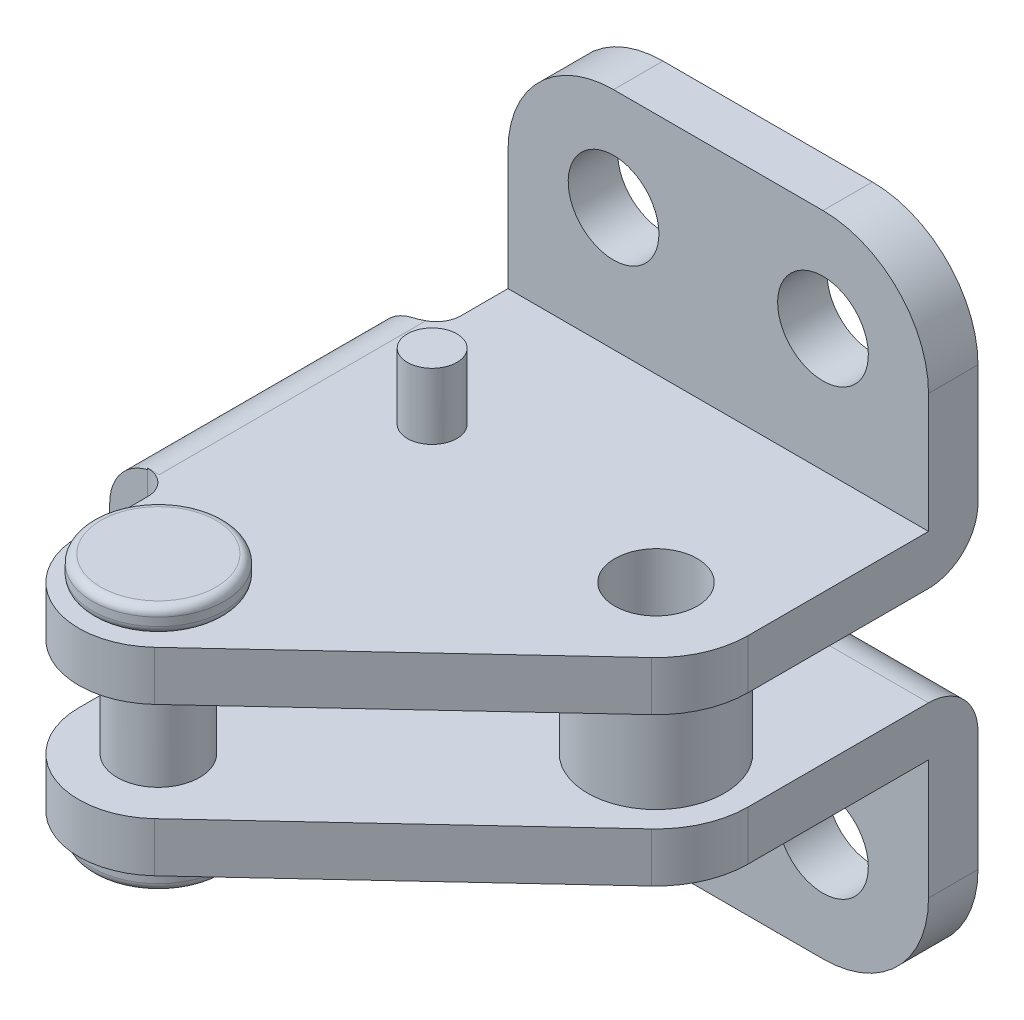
ISO-10303-21;
HEADER;
FILE_DESCRIPTION(('STEP AP214'),'2;1');
FILE_NAME('part.step','',(''),(''),'','','');
FILE_SCHEMA(('AUTOMOTIVE_DESIGN { 1 0 10303 214 1 1 1 1 }'));
ENDSEC;
DATA;
#1=APPLICATION_CONTEXT('core data for automotive mechanical design processes');
#2=APPLICATION_PROTOCOL_DEFINITION('international standard','automotive_design',2000,#1);
#3=PRODUCT_CONTEXT('',#1,'mechanical');
#4=PRODUCT('Part','Part','',(#3));
#5=PRODUCT_RELATED_PRODUCT_CATEGORY('part','',(#4));
#6=PRODUCT_DEFINITION_FORMATION('','',#4);
#7=PRODUCT_DEFINITION_CONTEXT('part definition',#1,'design');
#8=PRODUCT_DEFINITION('design','',#6,#7);
#9=PRODUCT_DEFINITION_SHAPE('','',#8);
#10=(LENGTH_UNIT() NAMED_UNIT(*) SI_UNIT(.MILLI.,.METRE.));
#11=(NAMED_UNIT(*) PLANE_ANGLE_UNIT() SI_UNIT($,.RADIAN.));
#12=(NAMED_UNIT(*) SI_UNIT($,.STERADIAN.) SOLID_ANGLE_UNIT());
#13=UNCERTAINTY_MEASURE_WITH_UNIT(LENGTH_MEASURE(1.E-05),#10,'distance_accuracy_value','');
#14=(GEOMETRIC_REPRESENTATION_CONTEXT(3) GLOBAL_UNCERTAINTY_ASSIGNED_CONTEXT((#13)) GLOBAL_UNIT_ASSIGNED_CONTEXT((#10,
#11,#12)) REPRESENTATION_CONTEXT('',''));
#15=CARTESIAN_POINT('',(0.,0.,0.));
#16=DIRECTION('',(0.,0.,1.));
#17=DIRECTION('',(1.,0.,0.));
#18=AXIS2_PLACEMENT_3D('',#15,#16,#17);
#19=CARTESIAN_POINT('',(-1.57399999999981,17.952,12.424));
#20=DIRECTION('',(0.,-1.,0.));
#21=DIRECTION('',(0.543277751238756,0.,-0.839553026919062));
#22=AXIS2_PLACEMENT_3D('',#19,#20,#21);
#23=CYLINDRICAL_SURFACE('',#22,1.5);
#24=CARTESIAN_POINT('',(-1.57399999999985,10.452,12.424));
#25=DIRECTION('',(0.,1.,0.));
#26=DIRECTION('',(-1.,0.,0.));
#27=AXIS2_PLACEMENT_3D('',#24,#25,#26);
#28=CIRCLE('',#27,1.5);
#29=CARTESIAN_POINT('',(-3.07399999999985,10.452,12.424));
#30=VERTEX_POINT('',#29);
#31=EDGE_CURVE('E595',#30,#30,#28,.F.);
#32=ORIENTED_EDGE('',*,*,#31,.F.);
#33=EDGE_LOOP('',(#32));
#34=FACE_BOUND('',#33,.T.);
#35=CARTESIAN_POINT('',(-1.57399999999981,16.452,12.424));
#36=DIRECTION('',(0.,-1.,0.));
#37=DIRECTION('',(0.,0.,1.));
#38=AXIS2_PLACEMENT_3D('',#35,#36,#37);
#39=CIRCLE('',#38,1.5);
#40=CARTESIAN_POINT('',(-1.57399999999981,16.452,13.924));
#41=VERTEX_POINT('',#40);
#42=EDGE_CURVE('E970',#41,#41,#39,.F.);
#43=ORIENTED_EDGE('',*,*,#42,.F.);
#44=EDGE_LOOP('',(#43));
#45=FACE_BOUND('',#44,.T.);
#46=ADVANCED_FACE('F14',(#34,#45),#23,.T.);
#47=CARTESIAN_POINT('',(-1.57399999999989,3.452,12.424));
#48=DIRECTION('',(0.,1.,0.));
#49=DIRECTION('',(-0.543277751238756,0.,0.839553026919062));
#50=AXIS2_PLACEMENT_3D('',#47,#48,#49);
#51=PLANE('',#50);
#52=CARTESIAN_POINT('',(-1.57399999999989,3.452,12.424));
#53=DIRECTION('',(0.,1.,0.));
#54=DIRECTION('',(-0.543277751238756,0.,0.839553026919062));
#55=AXIS2_PLACEMENT_3D('',#52,#53,#54);
#56=CIRCLE('',#55,1.5);
#57=CARTESIAN_POINT('',(-2.38891662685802,3.45200000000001,13.6833295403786));
#58=VERTEX_POINT('',#57);
#59=EDGE_CURVE('E973',#58,#58,#56,.T.);
#60=ORIENTED_EDGE('',*,*,#59,.F.);
#61=EDGE_LOOP('',(#60));
#62=FACE_BOUND('',#61,.T.);
#63=ADVANCED_FACE('F997',(#62),#51,.F.);
#64=CARTESIAN_POINT('',(-1.57399999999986,7.452,12.424));
#65=DIRECTION('',(0.,1.,0.));
#66=DIRECTION('',(-1.,0.,0.));
#67=AXIS2_PLACEMENT_3D('',#64,#65,#66);
#68=CIRCLE('',#67,1.5);
#69=CARTESIAN_POINT('',(-3.07399999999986,7.45200000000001,12.424));
#70=VERTEX_POINT('',#69);
#71=EDGE_CURVE('E26',#70,#70,#68,.T.);
#72=ORIENTED_EDGE('',*,*,#71,.F.);
#73=EDGE_LOOP('',(#72));
#74=FACE_BOUND('',#73,.T.);
#75=ORIENTED_EDGE('',*,*,#59,.T.);
#76=EDGE_LOOP('',(#75));
#77=FACE_BOUND('',#76,.T.);
#78=ADVANCED_FACE('F992',(#74,#77),#23,.T.);
#79=CARTESIAN_POINT('',(-1.5739999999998,19.452,12.424));
#80=DIRECTION('',(0.,1.,0.));
#81=DIRECTION('',(-1.,0.,0.));
#82=AXIS2_PLACEMENT_3D('',#79,#80,#81);
#83=CIRCLE('',#82,1.5);
#84=CARTESIAN_POINT('',(-3.0739999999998,19.452,12.424));
#85=VERTEX_POINT('',#84);
#86=EDGE_CURVE('E9',#85,#85,#83,.F.);
#87=ORIENTED_EDGE('',*,*,#86,.F.);
#88=EDGE_LOOP('',(#87));
#89=FACE_BOUND('',#88,.T.);
#90=CARTESIAN_POINT('',(-1.57399999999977,23.452,12.424));
#91=DIRECTION('',(0.,-1.,0.));
#92=DIRECTION('',(0.543277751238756,0.,-0.839553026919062));
#93=AXIS2_PLACEMENT_3D('',#90,#91,#92);
#94=CIRCLE('',#93,1.5);
#95=CARTESIAN_POINT('',(-0.759083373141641,23.452,11.1646704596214));
#96=VERTEX_POINT('',#95);
#97=EDGE_CURVE('E967',#96,#96,#94,.T.);
#98=ORIENTED_EDGE('',*,*,#97,.T.);
#99=EDGE_LOOP('',(#98));
#100=FACE_BOUND('',#99,.T.);
#101=ADVANCED_FACE('F979',(#89,#100),#23,.T.);
#102=CARTESIAN_POINT('',(-1.57399999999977,23.452,12.424));
#103=DIRECTION('',(0.,-1.,0.));
#104=DIRECTION('',(0.543277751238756,0.,-0.839553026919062));
#105=AXIS2_PLACEMENT_3D('',#102,#103,#104);
#106=PLANE('',#105);
#107=ORIENTED_EDGE('',*,*,#97,.F.);
#108=EDGE_LOOP('',(#107));
#109=FACE_BOUND('',#108,.T.);
#110=ADVANCED_FACE('F981',(#109),#106,.F.);
#111=CARTESIAN_POINT('',(-1.57399999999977,20.952,29.024));
#112=DIRECTION('',(0.,1.,0.));
#113=DIRECTION('',(0.719711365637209,0.,-0.694273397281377));
#114=AXIS2_PLACEMENT_3D('',#111,#112,#113);
#115=PLANE('',#114);
#116=CARTESIAN_POINT('',(-1.57399999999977,20.952,29.024));
#117=DIRECTION('',(0.,1.,0.));
#118=DIRECTION('',(0.719711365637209,0.,-0.694273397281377));
#119=AXIS2_PLACEMENT_3D('',#116,#117,#118);
#120=CIRCLE('',#119,3.5);
#121=CARTESIAN_POINT('',(0.944989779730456,20.952,26.5940431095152));
#122=VERTEX_POINT('',#121);
#123=EDGE_CURVE('E869',#122,#122,#120,.T.);
#124=ORIENTED_EDGE('',*,*,#123,.T.);
#125=EDGE_LOOP('',(#124));
#126=FACE_BOUND('',#125,.T.);
#127=ADVANCED_FACE('F983',(#126),#115,.T.);
#128=CARTESIAN_POINT('',(-1.57399999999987,5.95200000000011,29.024));
#129=DIRECTION('',(0.,1.,0.));
#130=DIRECTION('',(0.719711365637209,0.,-0.694273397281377));
#131=AXIS2_PLACEMENT_3D('',#128,#129,#130);
#132=PLANE('',#131);
#133=CARTESIAN_POINT('',(-1.57399999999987,5.95200000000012,29.024));
#134=DIRECTION('',(0.,1.,0.));
#135=DIRECTION('',(0.719711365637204,0.,-0.694273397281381));
#136=AXIS2_PLACEMENT_3D('',#133,#134,#135);
#137=CIRCLE('',#136,3.50000000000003);
#138=CARTESIAN_POINT('',(0.944989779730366,5.9520000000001,26.5940431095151));
#139=VERTEX_POINT('',#138);
#140=CARTESIAN_POINT('',(-4.0929897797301,5.95200000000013,31.4539568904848));
#141=VERTEX_POINT('',#140);
#142=EDGE_CURVE('E861',#139,#141,#137,.T.);
#143=ORIENTED_EDGE('',*,*,#142,.F.);
#144=CARTESIAN_POINT('',(-1.57399999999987,5.95200000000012,29.024));
#145=DIRECTION('',(0.,1.,0.));
#146=DIRECTION('',(-0.719711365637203,0.,0.694273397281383));
#147=AXIS2_PLACEMENT_3D('',#144,#145,#146);
#148=CIRCLE('',#147,3.50000000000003);
#149=EDGE_CURVE('E911',#141,#139,#148,.T.);
#150=ORIENTED_EDGE('',*,*,#149,.F.);
#151=EDGE_LOOP('',(#143,#150));
#152=FACE_BOUND('',#151,.T.);
#153=ADVANCED_FACE('F898',(#152),#132,.F.);
#154=CARTESIAN_POINT('',(-1.57399999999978,20.452,29.024));
#155=DIRECTION('',(0.,1.,0.));
#156=DIRECTION('',(0.719711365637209,0.,-0.694273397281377));
#157=AXIS2_PLACEMENT_3D('',#154,#155,#156);
#158=TOROIDAL_SURFACE('',#157,3.5,0.5);
#159=CARTESIAN_POINT('',(-1.57399999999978,20.452,29.024));
#160=DIRECTION('',(0.,1.,0.));
#161=DIRECTION('',(0.719711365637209,0.,-0.694273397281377));
#162=AXIS2_PLACEMENT_3D('',#159,#160,#161);
#163=CIRCLE('',#162,4.);
#164=CARTESIAN_POINT('',(1.30484546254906,20.452,26.2469064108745));
#165=VERTEX_POINT('',#164);
#166=EDGE_CURVE('E878',#165,#165,#163,.F.);
#167=ORIENTED_EDGE('',*,*,#166,.F.);
#168=EDGE_LOOP('',(#167));
#169=FACE_BOUND('',#168,.T.);
#170=ORIENTED_EDGE('',*,*,#123,.F.);
#171=EDGE_LOOP('',(#170));
#172=FACE_BOUND('',#171,.T.);
#173=ADVANCED_FACE('F896',(#169,#172),#158,.T.);
#174=CARTESIAN_POINT('',(-1.57399999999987,6.45200000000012,29.024));
#175=DIRECTION('',(0.,1.,0.));
#176=DIRECTION('',(0.719711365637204,0.,-0.694273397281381));
#177=AXIS2_PLACEMENT_3D('',#174,#175,#176);
#178=TOROIDAL_SURFACE('',#177,3.50000000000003,0.5);
#179=ORIENTED_EDGE('',*,*,#142,.T.);
#180=ORIENTED_EDGE('',*,*,#149,.T.);
#181=EDGE_LOOP('',(#179,#180));
#182=FACE_BOUND('',#181,.T.);
#183=CARTESIAN_POINT('',(-1.57399999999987,6.45200000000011,29.024));
#184=DIRECTION('',(0.,-1.,0.));
#185=DIRECTION('',(-0.719711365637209,0.,0.694273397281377));
#186=AXIS2_PLACEMENT_3D('',#183,#184,#185);
#187=CIRCLE('',#186,4.);
#188=CARTESIAN_POINT('',(-4.4528454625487,6.45200000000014,31.8010935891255));
#189=VERTEX_POINT('',#188);
#190=EDGE_CURVE('E908',#189,#189,#187,.F.);
#191=ORIENTED_EDGE('',*,*,#190,.F.);
#192=EDGE_LOOP('',(#191));
#193=FACE_BOUND('',#192,.T.);
#194=ADVANCED_FACE('F491',(#182,#193),#178,.T.);
#195=CARTESIAN_POINT('',(0.00160000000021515,-6.2,0.));
#196=DIRECTION('',(0.,1.,0.));
#197=DIRECTION('',(-1.,0.,0.));
#198=AXIS2_PLACEMENT_3D('',#195,#196,#197);
#199=PLANE('',#198);
#200=DIRECTION('',(0.,0.,1.));
#201=VECTOR('',#200,1.);
#202=CARTESIAN_POINT('',(0.00160000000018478,-6.2,0.));
#203=LINE('',#202,#201);
#204=CARTESIAN_POINT('',(0.00160000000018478,-6.2,0.));
#205=VERTEX_POINT('',#204);
#206=CARTESIAN_POINT('',(0.00160000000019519,-6.2,3.00000000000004));
#207=VERTEX_POINT('',#206);
#208=EDGE_CURVE('E304',#205,#207,#203,.T.);
#209=ORIENTED_EDGE('',*,*,#208,.F.);
#210=DIRECTION('',(1.,0.,0.));
#211=VECTOR('',#210,1.);
#212=CARTESIAN_POINT('',(12.7000000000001,-6.2,0.));
#213=LINE('',#212,#211);
#214=CARTESIAN_POINT('',(12.7000000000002,-6.2,0.));
#215=VERTEX_POINT('',#214);
#216=EDGE_CURVE('E564',#215,#205,#213,.F.);
#217=ORIENTED_EDGE('',*,*,#216,.F.);
#218=DIRECTION('',(0.,0.,1.));
#219=VECTOR('',#218,1.);
#220=CARTESIAN_POINT('',(12.7000000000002,-6.2,0.));
#221=LINE('',#220,#219);
#222=CARTESIAN_POINT('',(12.7000000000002,-6.2,3.00000000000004));
#223=VERTEX_POINT('',#222);
#224=EDGE_CURVE('E280',#223,#215,#221,.F.);
#225=ORIENTED_EDGE('',*,*,#224,.F.);
#226=DIRECTION('',(-1.,0.,0.));
#227=VECTOR('',#226,1.);
#228=CARTESIAN_POINT('',(0.00160000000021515,-6.2,3.00000000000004));
#229=LINE('',#228,#227);
#230=EDGE_CURVE('E277',#207,#223,#229,.F.);
#231=ORIENTED_EDGE('',*,*,#230,.F.);
#232=EDGE_LOOP('',(#209,#217,#225,#231));
#233=FACE_BOUND('',#232,.T.);
#234=ADVANCED_FACE('F487',(#233),#199,.F.);
#235=CARTESIAN_POINT('',(0.,0.,0.));
#236=DIRECTION('',(0.,0.,1.));
#237=DIRECTION('',(0.,-1.,0.));
#238=AXIS2_PLACEMENT_3D('',#235,#236,#237);
#239=CYLINDRICAL_SURFACE('',#238,2.75);
#240=CARTESIAN_POINT('',(0.,0.,0.));
#241=DIRECTION('',(0.,0.,1.));
#242=DIRECTION('',(0.,-1.,0.));
#243=AXIS2_PLACEMENT_3D('',#240,#241,#242);
#244=CIRCLE('',#243,2.75);
#245=CARTESIAN_POINT('',(0.,-2.75,0.));
#246=VERTEX_POINT('',#245);
#247=EDGE_CURVE('E467',#246,#246,#244,.T.);
#248=ORIENTED_EDGE('',*,*,#247,.F.);
#249=EDGE_LOOP('',(#248));
#250=FACE_BOUND('',#249,.T.);
#251=CARTESIAN_POINT('',(0.,0.,3.));
#252=DIRECTION('',(0.,0.,1.));
#253=DIRECTION('',(0.,-1.,0.));
#254=AXIS2_PLACEMENT_3D('',#251,#252,#253);
#255=CIRCLE('',#254,2.75);
#256=CARTESIAN_POINT('',(0.,-2.74999999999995,3.00000000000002));
#257=VERTEX_POINT('',#256);
#258=EDGE_CURVE('E522',#257,#257,#255,.F.);
#259=ORIENTED_EDGE('',*,*,#258,.F.);
#260=EDGE_LOOP('',(#259));
#261=FACE_BOUND('',#260,.T.);
#262=ADVANCED_FACE('F490',(#250,#261),#239,.F.);
#263=CARTESIAN_POINT('',(12.7,0.,0.));
#264=DIRECTION('',(0.,0.,1.));
#265=DIRECTION('',(0.,-1.,0.));
#266=AXIS2_PLACEMENT_3D('',#263,#264,#265);
#267=CYLINDRICAL_SURFACE('',#266,2.75);
#268=CARTESIAN_POINT('',(12.7,0.,0.));
#269=DIRECTION('',(0.,0.,1.));
#270=DIRECTION('',(0.,-1.,0.));
#271=AXIS2_PLACEMENT_3D('',#268,#269,#270);
#272=CIRCLE('',#271,2.75);
#273=CARTESIAN_POINT('',(12.7,-2.74999999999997,0.));
#274=VERTEX_POINT('',#273);
#275=EDGE_CURVE('E568',#274,#274,#272,.T.);
#276=ORIENTED_EDGE('',*,*,#275,.F.);
#277=EDGE_LOOP('',(#276));
#278=FACE_BOUND('',#277,.T.);
#279=CARTESIAN_POINT('',(12.7,0.,3.));
#280=DIRECTION('',(0.,0.,1.));
#281=DIRECTION('',(0.,-1.,0.));
#282=AXIS2_PLACEMENT_3D('',#279,#280,#281);
#283=CIRCLE('',#282,2.75);
#284=CARTESIAN_POINT('',(12.7,-2.74999999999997,3.00000000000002));
#285=VERTEX_POINT('',#284);
#286=EDGE_CURVE('E281',#285,#285,#283,.F.);
#287=ORIENTED_EDGE('',*,*,#286,.F.);
#288=EDGE_LOOP('',(#287));
#289=FACE_BOUND('',#288,.T.);
#290=ADVANCED_FACE('F495',(#278,#289),#267,.F.);
#291=CARTESIAN_POINT('',(-1.57399999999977,20.952,29.024));
#292=DIRECTION('',(0.,-1.,0.));
#293=DIRECTION('',(-0.719711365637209,0.,0.694273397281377));
#294=AXIS2_PLACEMENT_3D('',#291,#292,#293);
#295=CYLINDRICAL_SURFACE('',#294,4.);
#296=CARTESIAN_POINT('',(-1.57399999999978,19.952,29.024));
#297=DIRECTION('',(0.,1.,0.));
#298=DIRECTION('',(0.719711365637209,0.,-0.694273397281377));
#299=AXIS2_PLACEMENT_3D('',#296,#297,#298);
#300=CIRCLE('',#299,4.);
#301=CARTESIAN_POINT('',(1.30484546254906,19.952,26.2469064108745));
#302=VERTEX_POINT('',#301);
#303=EDGE_CURVE('E875',#302,#302,#300,.T.);
#304=ORIENTED_EDGE('',*,*,#303,.T.);
#305=EDGE_LOOP('',(#304));
#306=FACE_BOUND('',#305,.T.);
#307=ORIENTED_EDGE('',*,*,#166,.T.);
#308=EDGE_LOOP('',(#307));
#309=FACE_BOUND('',#308,.T.);
#310=ADVANCED_FACE('F497',(#306,#309),#295,.T.);
#311=CARTESIAN_POINT('',(0.00160000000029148,33.102,0.));
#312=DIRECTION('',(0.,-1.,0.));
#313=DIRECTION('',(0.,0.,-1.));
#314=AXIS2_PLACEMENT_3D('',#311,#312,#313);
#315=PLANE('',#314);
#316=DIRECTION('',(0.,0.,1.));
#317=VECTOR('',#316,1.);
#318=CARTESIAN_POINT('',(12.7000000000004,33.102,0.));
#319=LINE('',#318,#317);
#320=CARTESIAN_POINT('',(12.7000000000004,33.102,0.));
#321=VERTEX_POINT('',#320);
#322=CARTESIAN_POINT('',(12.7000000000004,33.102,2.9999999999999));
#323=VERTEX_POINT('',#322);
#324=EDGE_CURVE('E693',#321,#323,#319,.T.);
#325=ORIENTED_EDGE('',*,*,#324,.F.);
#326=DIRECTION('',(1.,0.,0.));
#327=VECTOR('',#326,1.);
#328=CARTESIAN_POINT('',(-35.9999869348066,33.102,0.));
#329=LINE('',#328,#327);
#330=CARTESIAN_POINT('',(0.00160000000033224,33.102,0.));
#331=VERTEX_POINT('',#330);
#332=EDGE_CURVE('E387',#331,#321,#329,.T.);
#333=ORIENTED_EDGE('',*,*,#332,.F.);
#334=DIRECTION('',(0.,0.,-1.));
#335=VECTOR('',#334,1.);
#336=CARTESIAN_POINT('',(0.00160000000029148,33.102,0.));
#337=LINE('',#336,#335);
#338=CARTESIAN_POINT('',(0.00160000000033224,33.102,2.9999999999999));
#339=VERTEX_POINT('',#338);
#340=EDGE_CURVE('E696',#339,#331,#337,.T.);
#341=ORIENTED_EDGE('',*,*,#340,.F.);
#342=DIRECTION('',(1.,0.,0.));
#343=VECTOR('',#342,1.);
#344=CARTESIAN_POINT('',(-35.9999869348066,33.102,2.9999999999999));
#345=LINE('',#344,#343);
#346=EDGE_CURVE('E628',#339,#323,#345,.T.);
#347=ORIENTED_EDGE('',*,*,#346,.T.);
#348=EDGE_LOOP('',(#325,#333,#341,#347));
#349=FACE_BOUND('',#348,.T.);
#350=ADVANCED_FACE('F795',(#349),#315,.F.);
#351=CARTESIAN_POINT('',(0.00160000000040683,26.902,0.));
#352=DIRECTION('',(0.,0.,1.));
#353=DIRECTION('',(0.,-1.,0.));
#354=AXIS2_PLACEMENT_3D('',#351,#352,#353);
#355=CYLINDRICAL_SURFACE('',#354,2.75);
#356=CARTESIAN_POINT('',(0.00160000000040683,26.902,0.));
#357=DIRECTION('',(0.,0.,1.));
#358=DIRECTION('',(0.,-1.,0.));
#359=AXIS2_PLACEMENT_3D('',#356,#357,#358);
#360=CIRCLE('',#359,2.75);
#361=CARTESIAN_POINT('',(0.00160000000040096,24.152,0.));
#362=VERTEX_POINT('',#361);
#363=EDGE_CURVE('E392',#362,#362,#360,.T.);
#364=ORIENTED_EDGE('',*,*,#363,.F.);
#365=EDGE_LOOP('',(#364));
#366=FACE_BOUND('',#365,.T.);
#367=CARTESIAN_POINT('',(0.00160000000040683,26.902,2.9999999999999));
#368=DIRECTION('',(0.,0.,1.));
#369=DIRECTION('',(0.,-1.,0.));
#370=AXIS2_PLACEMENT_3D('',#367,#368,#369);
#371=CIRCLE('',#370,2.75);
#372=CARTESIAN_POINT('',(0.00160000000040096,24.152,2.9999999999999));
#373=VERTEX_POINT('',#372);
#374=EDGE_CURVE('E632',#373,#373,#371,.T.);
#375=ORIENTED_EDGE('',*,*,#374,.T.);
#376=EDGE_LOOP('',(#375));
#377=FACE_BOUND('',#376,.T.);
#378=ADVANCED_FACE('F1015',(#366,#377),#355,.F.);
#379=CARTESIAN_POINT('',(12.7016000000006,26.902,0.));
#380=DIRECTION('',(0.,0.,1.));
#381=DIRECTION('',(0.,-1.,0.));
#382=AXIS2_PLACEMENT_3D('',#379,#380,#381);
#383=CYLINDRICAL_SURFACE('',#382,2.75);
#384=CARTESIAN_POINT('',(12.7016000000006,26.902,0.));
#385=DIRECTION('',(0.,0.,1.));
#386=DIRECTION('',(0.,-1.,0.));
#387=AXIS2_PLACEMENT_3D('',#384,#385,#386);
#388=CIRCLE('',#387,2.75);
#389=CARTESIAN_POINT('',(12.7016000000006,24.152,0.));
#390=VERTEX_POINT('',#389);
#391=EDGE_CURVE('E396',#390,#390,#388,.T.);
#392=ORIENTED_EDGE('',*,*,#391,.F.);
#393=EDGE_LOOP('',(#392));
#394=FACE_BOUND('',#393,.T.);
#395=CARTESIAN_POINT('',(12.7016000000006,26.902,2.9999999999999));
#396=DIRECTION('',(0.,0.,1.));
#397=DIRECTION('',(0.,-1.,0.));
#398=AXIS2_PLACEMENT_3D('',#395,#396,#397);
#399=CIRCLE('',#398,2.75);
#400=CARTESIAN_POINT('',(12.7016000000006,24.152,2.9999999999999));
#401=VERTEX_POINT('',#400);
#402=EDGE_CURVE('E408',#401,#401,#399,.T.);
#403=ORIENTED_EDGE('',*,*,#402,.T.);
#404=EDGE_LOOP('',(#403));
#405=FACE_BOUND('',#404,.T.);
#406=ADVANCED_FACE('F542',(#394,#405),#383,.F.);
#407=CARTESIAN_POINT('',(13.5136000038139,16.452,13.9364));
#408=DIRECTION('',(0.,-1.,0.));
#409=DIRECTION('',(0.923728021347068,0.,-0.383049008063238));
#410=AXIS2_PLACEMENT_3D('',#407,#408,#409);
#411=CYLINDRICAL_SURFACE('',#410,2.5);
#412=CARTESIAN_POINT('',(13.5136000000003,7.45200000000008,13.9364));
#413=DIRECTION('',(0.,-1.,0.));
#414=DIRECTION('',(1.,0.,0.));
#415=AXIS2_PLACEMENT_3D('',#412,#413,#414);
#416=CIRCLE('',#415,2.49999999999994);
#417=CARTESIAN_POINT('',(16.0136000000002,7.45200000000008,13.9364));
#418=VERTEX_POINT('',#417);
#419=EDGE_CURVE('E621',#418,#418,#416,.F.);
#420=ORIENTED_EDGE('',*,*,#419,.F.);
#421=EDGE_LOOP('',(#420));
#422=FACE_BOUND('',#421,.T.);
#423=CARTESIAN_POINT('',(13.5136000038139,19.452,13.9364));
#424=DIRECTION('',(0.,1.,0.));
#425=DIRECTION('',(-1.,0.,0.));
#426=AXIS2_PLACEMENT_3D('',#423,#424,#425);
#427=CIRCLE('',#426,2.49999999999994);
#428=CARTESIAN_POINT('',(11.013600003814,19.452,13.9364));
#429=VERTEX_POINT('',#428);
#430=EDGE_CURVE('E328',#429,#429,#427,.F.);
#431=ORIENTED_EDGE('',*,*,#430,.F.);
#432=EDGE_LOOP('',(#431));
#433=FACE_BOUND('',#432,.T.);
#434=ADVANCED_FACE('F999',(#422,#433),#411,.F.);
#435=CARTESIAN_POINT('',(-1.57399999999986,7.45200000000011,29.024));
#436=DIRECTION('',(0.,-1.,0.));
#437=DIRECTION('',(-0.719711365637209,0.,0.694273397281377));
#438=AXIS2_PLACEMENT_3D('',#435,#436,#437);
#439=CYLINDRICAL_SURFACE('',#438,4.);
#440=CARTESIAN_POINT('',(-1.57399999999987,6.95200000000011,29.024));
#441=DIRECTION('',(0.,1.,0.));
#442=DIRECTION('',(0.719711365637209,0.,-0.694273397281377));
#443=AXIS2_PLACEMENT_3D('',#440,#441,#442);
#444=CIRCLE('',#443,4.);
#445=CARTESIAN_POINT('',(1.30484546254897,6.95200000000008,26.2469064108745));
#446=VERTEX_POINT('',#445);
#447=EDGE_CURVE('E906',#446,#446,#444,.T.);
#448=ORIENTED_EDGE('',*,*,#447,.F.);
#449=EDGE_LOOP('',(#448));
#450=FACE_BOUND('',#449,.T.);
#451=ORIENTED_EDGE('',*,*,#190,.T.);
#452=EDGE_LOOP('',(#451));
#453=FACE_BOUND('',#452,.T.);
#454=ADVANCED_FACE('F485',(#450,#453),#439,.T.);
#455=CARTESIAN_POINT('',(0.0016000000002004,0.201600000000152,0.));
#456=DIRECTION('',(0.,0.,1.));
#457=DIRECTION('',(0.,-1.,0.));
#458=AXIS2_PLACEMENT_3D('',#455,#456,#457);
#459=CYLINDRICAL_SURFACE('',#458,6.40160000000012);
#460=CARTESIAN_POINT('',(0.0016000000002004,0.201600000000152,0.));
#461=DIRECTION('',(0.,0.,1.));
#462=DIRECTION('',(0.,-1.,0.));
#463=AXIS2_PLACEMENT_3D('',#460,#461,#462);
#464=CIRCLE('',#463,6.40160000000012);
#465=CARTESIAN_POINT('',(-6.3999999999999,0.201600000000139,0.));
#466=VERTEX_POINT('',#465);
#467=EDGE_CURVE('E574',#205,#466,#464,.F.);
#468=ORIENTED_EDGE('',*,*,#467,.F.);
#469=ORIENTED_EDGE('',*,*,#208,.T.);
#470=CARTESIAN_POINT('',(0.0016000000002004,0.201600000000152,3.));
#471=DIRECTION('',(0.,0.,1.));
#472=DIRECTION('',(0.,-1.,0.));
#473=AXIS2_PLACEMENT_3D('',#470,#471,#472);
#474=CIRCLE('',#473,6.40160000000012);
#475=CARTESIAN_POINT('',(-6.3999999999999,0.201600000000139,3.));
#476=VERTEX_POINT('',#475);
#477=EDGE_CURVE('E307',#207,#476,#474,.F.);
#478=ORIENTED_EDGE('',*,*,#477,.T.);
#479=DIRECTION('',(0.,0.,1.));
#480=VECTOR('',#479,1.);
#481=CARTESIAN_POINT('',(-6.3999999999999,0.201600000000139,0.));
#482=LINE('',#481,#480);
#483=EDGE_CURVE('E290',#476,#466,#482,.F.);
#484=ORIENTED_EDGE('',*,*,#483,.T.);
#485=EDGE_LOOP('',(#468,#469,#478,#484));
#486=FACE_BOUND('',#485,.T.);
#487=ADVANCED_FACE('F482',(#486),#459,.T.);
#488=CARTESIAN_POINT('',(12.7000000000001,0.201600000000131,0.));
#489=DIRECTION('',(0.,0.,-1.));
#490=DIRECTION('',(0.,1.,0.));
#491=AXIS2_PLACEMENT_3D('',#488,#489,#490);
#492=PLANE('',#491);
#493=ORIENTED_EDGE('',*,*,#216,.T.);
#494=ORIENTED_EDGE('',*,*,#467,.T.);
#495=DIRECTION('',(0.,1.,0.));
#496=VECTOR('',#495,1.);
#497=CARTESIAN_POINT('',(-6.3999999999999,0.20160000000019,0.));
#498=LINE('',#497,#496);
#499=CARTESIAN_POINT('',(-6.39999999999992,7.451,0.));
#500=VERTEX_POINT('',#499);
#501=EDGE_CURVE('E570',#466,#500,#498,.T.);
#502=ORIENTED_EDGE('',*,*,#501,.T.);
#503=DIRECTION('',(-1.,0.,0.));
#504=VECTOR('',#503,1.);
#505=CARTESIAN_POINT('',(32.0331208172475,7.451,0.));
#506=LINE('',#505,#504);
#507=CARTESIAN_POINT('',(19.1016000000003,7.451,0.));
#508=VERTEX_POINT('',#507);
#509=EDGE_CURVE('E599',#508,#500,#506,.T.);
#510=ORIENTED_EDGE('',*,*,#509,.F.);
#511=DIRECTION('',(0.,1.,0.));
#512=VECTOR('',#511,1.);
#513=CARTESIAN_POINT('',(19.1016000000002,0.201600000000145,0.));
#514=LINE('',#513,#512);
#515=CARTESIAN_POINT('',(19.1016000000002,0.201600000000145,0.));
#516=VERTEX_POINT('',#515);
#517=EDGE_CURVE('E571',#508,#516,#514,.F.);
#518=ORIENTED_EDGE('',*,*,#517,.T.);
#519=CARTESIAN_POINT('',(12.7000000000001,0.201600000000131,0.));
#520=DIRECTION('',(0.,0.,1.));
#521=DIRECTION('',(0.,-1.,0.));
#522=AXIS2_PLACEMENT_3D('',#519,#520,#521);
#523=CIRCLE('',#522,6.40160000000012);
#524=EDGE_CURVE('E287',#516,#215,#523,.F.);
#525=ORIENTED_EDGE('',*,*,#524,.T.);
#526=EDGE_LOOP('',(#493,#494,#502,#510,#518,#525));
#527=FACE_BOUND('',#526,.T.);
#528=ORIENTED_EDGE('',*,*,#275,.T.);
#529=EDGE_LOOP('',(#528));
#530=FACE_BOUND('',#529,.T.);
#531=ORIENTED_EDGE('',*,*,#247,.T.);
#532=EDGE_LOOP('',(#531));
#533=FACE_BOUND('',#532,.T.);
#534=ADVANCED_FACE('F477',(#527,#530,#533),#492,.T.);
#535=CARTESIAN_POINT('',(12.7000000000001,0.201600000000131,0.));
#536=DIRECTION('',(0.,0.,1.));
#537=DIRECTION('',(0.,-1.,0.));
#538=AXIS2_PLACEMENT_3D('',#535,#536,#537);
#539=CYLINDRICAL_SURFACE('',#538,6.40160000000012);
#540=ORIENTED_EDGE('',*,*,#524,.F.);
#541=DIRECTION('',(0.,0.,1.));
#542=VECTOR('',#541,1.);
#543=CARTESIAN_POINT('',(19.1016000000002,0.201600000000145,0.));
#544=LINE('',#543,#542);
#545=CARTESIAN_POINT('',(19.1016000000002,0.201600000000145,3.));
#546=VERTEX_POINT('',#545);
#547=EDGE_CURVE('E284',#516,#546,#544,.T.);
#548=ORIENTED_EDGE('',*,*,#547,.T.);
#549=CARTESIAN_POINT('',(12.7000000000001,0.20160000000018,3.));
#550=DIRECTION('',(0.,0.,1.));
#551=DIRECTION('',(0.,-1.,0.));
#552=AXIS2_PLACEMENT_3D('',#549,#550,#551);
#553=CIRCLE('',#552,6.40160000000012);
#554=EDGE_CURVE('E271',#546,#223,#553,.F.);
#555=ORIENTED_EDGE('',*,*,#554,.T.);
#556=ORIENTED_EDGE('',*,*,#224,.T.);
#557=EDGE_LOOP('',(#540,#548,#555,#556));
#558=FACE_BOUND('',#557,.T.);
#559=ADVANCED_FACE('F285',(#558),#539,.T.);
#560=CARTESIAN_POINT('',(12.7000000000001,0.20160000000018,3.));
#561=DIRECTION('',(0.,0.,-1.));
#562=DIRECTION('',(0.,1.,0.));
#563=AXIS2_PLACEMENT_3D('',#560,#561,#562);
#564=PLANE('',#563);
#565=ORIENTED_EDGE('',*,*,#286,.T.);
#566=EDGE_LOOP('',(#565));
#567=FACE_BOUND('',#566,.T.);
#568=ORIENTED_EDGE('',*,*,#258,.T.);
#569=EDGE_LOOP('',(#568));
#570=FACE_BOUND('',#569,.T.);
#571=DIRECTION('',(0.,1.,0.));
#572=VECTOR('',#571,1.);
#573=CARTESIAN_POINT('',(-6.3999999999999,0.201600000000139,3.));
#574=LINE('',#573,#572);
#575=CARTESIAN_POINT('',(-6.39999999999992,7.451,2.99999999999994));
#576=VERTEX_POINT('',#575);
#577=EDGE_CURVE('E302',#576,#476,#574,.F.);
#578=ORIENTED_EDGE('',*,*,#577,.T.);
#579=ORIENTED_EDGE('',*,*,#477,.F.);
#580=ORIENTED_EDGE('',*,*,#230,.T.);
#581=ORIENTED_EDGE('',*,*,#554,.F.);
#582=DIRECTION('',(0.,-1.,0.));
#583=VECTOR('',#582,1.);
#584=CARTESIAN_POINT('',(19.1016000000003,18.8864,2.99999999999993));
#585=LINE('',#584,#583);
#586=CARTESIAN_POINT('',(19.1016000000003,7.451,2.99999999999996));
#587=VERTEX_POINT('',#586);
#588=EDGE_CURVE('E274',#546,#587,#585,.F.);
#589=ORIENTED_EDGE('',*,*,#588,.T.);
#590=DIRECTION('',(-1.,0.,0.));
#591=VECTOR('',#590,1.);
#592=CARTESIAN_POINT('',(32.0331208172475,7.45100000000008,2.99999999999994));
#593=LINE('',#592,#591);
#594=EDGE_CURVE('E296',#587,#576,#593,.T.);
#595=ORIENTED_EDGE('',*,*,#594,.T.);
#596=EDGE_LOOP('',(#578,#579,#580,#581,#589,#595));
#597=FACE_BOUND('',#596,.T.);
#598=ADVANCED_FACE('F16',(#567,#570,#597),#564,.F.);
#599=CARTESIAN_POINT('',(-10.1999934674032,16.452,-0.00100000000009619));
#600=DIRECTION('',(1.,0.,0.));
#601=DIRECTION('',(0.,1.,0.));
#602=AXIS2_PLACEMENT_3D('',#599,#600,#601);
#603=PLANE('',#602);
#604=DIRECTION('',(0.,0.,1.));
#605=VECTOR('',#604,1.);
#606=CARTESIAN_POINT('',(-10.1999934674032,10.452,-0.00100000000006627));
#607=LINE('',#606,#605);
#608=CARTESIAN_POINT('',(-10.1999934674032,10.452,23.35));
#609=VERTEX_POINT('',#608);
#610=CARTESIAN_POINT('',(-10.1999934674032,10.452,7.35));
#611=VERTEX_POINT('',#610);
#612=EDGE_CURVE('E592',#609,#611,#607,.F.);
#613=ORIENTED_EDGE('',*,*,#612,.F.);
#614=DIRECTION('',(0.,1.,0.));
#615=VECTOR('',#614,1.);
#616=CARTESIAN_POINT('',(-10.1999934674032,9.70200653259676,23.35));
#617=LINE('',#616,#615);
#618=CARTESIAN_POINT('',(-10.1999934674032,16.452,23.35));
#619=VERTEX_POINT('',#618);
#620=EDGE_CURVE('E666',#609,#619,#617,.T.);
#621=ORIENTED_EDGE('',*,*,#620,.T.);
#622=DIRECTION('',(0.,0.,1.));
#623=VECTOR('',#622,1.);
#624=CARTESIAN_POINT('',(-10.1999934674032,16.452,-0.00100000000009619));
#625=LINE('',#624,#623);
#626=CARTESIAN_POINT('',(-10.1999934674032,16.452,7.35));
#627=VERTEX_POINT('',#626);
#628=EDGE_CURVE('E407',#627,#619,#625,.T.);
#629=ORIENTED_EDGE('',*,*,#628,.F.);
#630=DIRECTION('',(0.,1.,0.));
#631=VECTOR('',#630,1.);
#632=CARTESIAN_POINT('',(-10.1999934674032,9.7020065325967,7.35));
#633=LINE('',#632,#631);
#634=EDGE_CURVE('E380',#627,#611,#633,.F.);
#635=ORIENTED_EDGE('',*,*,#634,.T.);
#636=EDGE_LOOP('',(#613,#621,#629,#635));
#637=FACE_BOUND('',#636,.T.);
#638=ADVANCED_FACE('F508',(#637),#603,.F.);
#639=CARTESIAN_POINT('',(12.7000000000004,26.7004,0.));
#640=DIRECTION('',(0.,0.,1.));
#641=DIRECTION('',(0.,-1.,0.));
#642=AXIS2_PLACEMENT_3D('',#639,#640,#641);
#643=CYLINDRICAL_SURFACE('',#642,6.40160000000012);
#644=CARTESIAN_POINT('',(12.7000000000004,26.7004,0.));
#645=DIRECTION('',(0.,0.,1.));
#646=DIRECTION('',(0.,-1.,0.));
#647=AXIS2_PLACEMENT_3D('',#644,#645,#646);
#648=CIRCLE('',#647,6.40160000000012);
#649=CARTESIAN_POINT('',(19.1016000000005,26.7004,0.));
#650=VERTEX_POINT('',#649);
#651=EDGE_CURVE('E384',#321,#650,#648,.F.);
#652=ORIENTED_EDGE('',*,*,#651,.F.);
#653=ORIENTED_EDGE('',*,*,#324,.T.);
#654=CARTESIAN_POINT('',(12.7000000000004,26.7004,2.9999999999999));
#655=DIRECTION('',(0.,0.,1.));
#656=DIRECTION('',(0.,-1.,0.));
#657=AXIS2_PLACEMENT_3D('',#654,#655,#656);
#658=CIRCLE('',#657,6.40160000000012);
#659=CARTESIAN_POINT('',(19.1016000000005,26.7004,2.9999999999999));
#660=VERTEX_POINT('',#659);
#661=EDGE_CURVE('E630',#323,#660,#658,.F.);
#662=ORIENTED_EDGE('',*,*,#661,.T.);
#663=DIRECTION('',(0.,0.,1.));
#664=VECTOR('',#663,1.);
#665=CARTESIAN_POINT('',(19.1016000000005,26.7004,-1.66316613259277E-13));
#666=LINE('',#665,#664);
#667=EDGE_CURVE('E590',#660,#650,#666,.F.);
#668=ORIENTED_EDGE('',*,*,#667,.T.);
#669=EDGE_LOOP('',(#652,#653,#662,#668));
#670=FACE_BOUND('',#669,.T.);
#671=ADVANCED_FACE('F514',(#670),#643,.T.);
#672=CARTESIAN_POINT('',(-35.9999869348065,26.7004,0.));
#673=DIRECTION('',(0.,0.,-1.));
#674=DIRECTION('',(0.,1.,0.));
#675=AXIS2_PLACEMENT_3D('',#672,#673,#674);
#676=PLANE('',#675);
#677=ORIENTED_EDGE('',*,*,#332,.T.);
#678=ORIENTED_EDGE('',*,*,#651,.T.);
#679=DIRECTION('',(0.,1.,0.));
#680=VECTOR('',#679,1.);
#681=CARTESIAN_POINT('',(19.1016000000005,26.7004,0.));
#682=LINE('',#681,#680);
#683=CARTESIAN_POINT('',(19.1016000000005,19.452,0.));
#684=VERTEX_POINT('',#683);
#685=EDGE_CURVE('E395',#650,#684,#682,.F.);
#686=ORIENTED_EDGE('',*,*,#685,.T.);
#687=DIRECTION('',(-1.,0.,0.));
#688=VECTOR('',#687,1.);
#689=CARTESIAN_POINT('',(-6.39999999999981,19.452,0.));
#690=LINE('',#689,#688);
#691=CARTESIAN_POINT('',(-6.39999999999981,19.452,0.));
#692=VERTEX_POINT('',#691);
#693=EDGE_CURVE('E353',#692,#684,#690,.F.);
#694=ORIENTED_EDGE('',*,*,#693,.F.);
#695=DIRECTION('',(0.,1.,0.));
#696=VECTOR('',#695,1.);
#697=CARTESIAN_POINT('',(-6.39999999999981,26.7004,0.));
#698=LINE('',#697,#696);
#699=CARTESIAN_POINT('',(-6.39999999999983,26.7004,0.));
#700=VERTEX_POINT('',#699);
#701=EDGE_CURVE('E391',#692,#700,#698,.T.);
#702=ORIENTED_EDGE('',*,*,#701,.T.);
#703=CARTESIAN_POINT('',(0.00160000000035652,26.7004,0.));
#704=DIRECTION('',(0.,0.,1.));
#705=DIRECTION('',(0.,-1.,0.));
#706=AXIS2_PLACEMENT_3D('',#703,#704,#705);
#707=CIRCLE('',#706,6.40160000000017);
#708=EDGE_CURVE('E388',#700,#331,#707,.F.);
#709=ORIENTED_EDGE('',*,*,#708,.T.);
#710=EDGE_LOOP('',(#677,#678,#686,#694,#702,#709));
#711=FACE_BOUND('',#710,.T.);
#712=ORIENTED_EDGE('',*,*,#363,.T.);
#713=EDGE_LOOP('',(#712));
#714=FACE_BOUND('',#713,.T.);
#715=ORIENTED_EDGE('',*,*,#391,.T.);
#716=EDGE_LOOP('',(#715));
#717=FACE_BOUND('',#716,.T.);
#718=ADVANCED_FACE('F422',(#711,#714,#717),#676,.T.);
#719=CARTESIAN_POINT('',(0.00160000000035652,26.7004,0.));
#720=DIRECTION('',(0.,0.,1.));
#721=DIRECTION('',(0.,-1.,0.));
#722=AXIS2_PLACEMENT_3D('',#719,#720,#721);
#723=CYLINDRICAL_SURFACE('',#722,6.40160000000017);
#724=ORIENTED_EDGE('',*,*,#708,.F.);
#725=DIRECTION('',(0.,0.,1.));
#726=VECTOR('',#725,1.);
#727=CARTESIAN_POINT('',(-6.39999999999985,26.7004,0.));
#728=LINE('',#727,#726);
#729=CARTESIAN_POINT('',(-6.39999999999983,26.7004,2.9999999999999));
#730=VERTEX_POINT('',#729);
#731=EDGE_CURVE('E624',#700,#730,#728,.T.);
#732=ORIENTED_EDGE('',*,*,#731,.T.);
#733=CARTESIAN_POINT('',(0.00160000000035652,26.7004,2.9999999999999));
#734=DIRECTION('',(0.,0.,1.));
#735=DIRECTION('',(0.,-1.,0.));
#736=AXIS2_PLACEMENT_3D('',#733,#734,#735);
#737=CIRCLE('',#736,6.40160000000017);
#738=EDGE_CURVE('E626',#730,#339,#737,.F.);
#739=ORIENTED_EDGE('',*,*,#738,.T.);
#740=ORIENTED_EDGE('',*,*,#340,.T.);
#741=EDGE_LOOP('',(#724,#732,#739,#740));
#742=FACE_BOUND('',#741,.T.);
#743=ADVANCED_FACE('F791',(#742),#723,.T.);
#744=CARTESIAN_POINT('',(-1.57399999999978,19.952,29.024));
#745=DIRECTION('',(0.,1.,0.));
#746=DIRECTION('',(0.719711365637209,0.,-0.694273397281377));
#747=AXIS2_PLACEMENT_3D('',#744,#745,#746);
#748=TOROIDAL_SURFACE('',#747,3.5,0.5);
#749=CARTESIAN_POINT('',(-1.57399999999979,19.452,29.024));
#750=DIRECTION('',(0.,1.,0.));
#751=DIRECTION('',(0.719711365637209,0.,-0.694273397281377));
#752=AXIS2_PLACEMENT_3D('',#749,#750,#751);
#753=CIRCLE('',#752,3.5);
#754=CARTESIAN_POINT('',(0.944989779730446,19.452,26.5940431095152));
#755=VERTEX_POINT('',#754);
#756=EDGE_CURVE('E872',#755,#755,#753,.F.);
#757=ORIENTED_EDGE('',*,*,#756,.F.);
#758=EDGE_LOOP('',(#757));
#759=FACE_BOUND('',#758,.T.);
#760=ORIENTED_EDGE('',*,*,#303,.F.);
#761=EDGE_LOOP('',(#760));
#762=FACE_BOUND('',#761,.T.);
#763=ADVANCED_FACE('F420',(#759,#762),#748,.T.);
#764=CARTESIAN_POINT('',(-7.19999346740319,16.452,-0.00100000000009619));
#765=DIRECTION('',(0.,0.,1.));
#766=DIRECTION('',(1.,0.,0.));
#767=AXIS2_PLACEMENT_3D('',#764,#765,#766);
#768=CYLINDRICAL_SURFACE('',#767,3.);
#769=CARTESIAN_POINT('',(-7.19999346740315,19.452,7.17664646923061));
#770=CARTESIAN_POINT('',(-7.23446432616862,19.4520051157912,7.1948419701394));
#771=CARTESIAN_POINT('',(-7.26965276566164,19.4514060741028,7.21168467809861));
#772=CARTESIAN_POINT('',(-7.3412048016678,19.448887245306,7.24257389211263));
#773=CARTESIAN_POINT('',(-7.37756880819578,19.4469669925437,7.25661941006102));
#774=CARTESIAN_POINT('',(-7.45036846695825,19.4417518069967,7.28153047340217));
#775=CARTESIAN_POINT('',(-7.48678453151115,19.4384884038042,7.29245980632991));
#776=CARTESIAN_POINT('',(-7.56017630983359,19.4305283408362,7.31149129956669));
#777=CARTESIAN_POINT('',(-7.59715177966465,19.4258322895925,7.31959465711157));
#778=CARTESIAN_POINT('',(-7.67815608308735,19.4139791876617,7.33417315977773));
#779=CARTESIAN_POINT('',(-7.72224467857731,19.4065298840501,7.34008414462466));
#780=CARTESIAN_POINT('',(-7.81097539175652,19.3894802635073,7.34803049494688));
#781=CARTESIAN_POINT('',(-7.85561699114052,19.3798524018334,7.35001274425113));
#782=CARTESIAN_POINT('',(-7.89999999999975,19.3691888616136,7.35));
#783=B_SPLINE_CURVE_WITH_KNOTS('',3,(#769,#770,#771,#772,#773,#774,#775,#776,#777,#778,#779,
#780,#781,#782),.UNSPECIFIED.,.F.,.F.,(4,2,2,2,2,2,4),(0.,0.116905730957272,0.233852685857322,
0.348198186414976,0.462495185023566,0.597579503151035,0.734478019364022),.UNSPECIFIED.);
#784=CARTESIAN_POINT('',(-7.19999346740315,19.452,7.17664646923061));
#785=VERTEX_POINT('',#784);
#786=CARTESIAN_POINT('',(-7.89999999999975,19.3691888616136,7.35));
#787=VERTEX_POINT('',#786);
#788=EDGE_CURVE('E399',#785,#787,#783,.T.);
#789=ORIENTED_EDGE('',*,*,#788,.T.);
#790=CARTESIAN_POINT('',(-7.19999346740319,16.452,7.35));
#791=DIRECTION('',(0.,0.,1.));
#792=DIRECTION('',(1.,0.,0.));
#793=AXIS2_PLACEMENT_3D('',#790,#791,#792);
#794=CIRCLE('',#793,3.);
#795=EDGE_CURVE('E358',#787,#627,#794,.T.);
#796=ORIENTED_EDGE('',*,*,#795,.T.);
#797=ORIENTED_EDGE('',*,*,#628,.T.);
#798=CARTESIAN_POINT('',(-7.19999346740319,16.452,23.35));
#799=DIRECTION('',(0.,0.,1.));
#800=DIRECTION('',(1.,0.,0.));
#801=AXIS2_PLACEMENT_3D('',#798,#799,#800);
#802=CIRCLE('',#801,3.);
#803=CARTESIAN_POINT('',(-7.89999999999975,19.3691888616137,23.35));
#804=VERTEX_POINT('',#803);
#805=EDGE_CURVE('E381',#619,#804,#802,.F.);
#806=ORIENTED_EDGE('',*,*,#805,.T.);
#807=CARTESIAN_POINT('',(-7.19999346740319,16.452,23.35));
#808=DIRECTION('',(0.,0.,1.));
#809=DIRECTION('',(1.,0.,0.));
#810=AXIS2_PLACEMENT_3D('',#807,#808,#809);
#811=CIRCLE('',#810,3.);
#812=CARTESIAN_POINT('',(-7.19999346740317,19.452,23.35));
#813=VERTEX_POINT('',#812);
#814=EDGE_CURVE('E378',#804,#813,#811,.F.);
#815=ORIENTED_EDGE('',*,*,#814,.T.);
#816=DIRECTION('',(0.,0.,1.));
#817=VECTOR('',#816,1.);
#818=CARTESIAN_POINT('',(-7.19999346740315,19.452,-4.7484));
#819=LINE('',#818,#817);
#820=EDGE_CURVE('E356',#813,#785,#819,.F.);
#821=ORIENTED_EDGE('',*,*,#820,.T.);
#822=EDGE_LOOP('',(#789,#796,#797,#806,#815,#821));
#823=FACE_BOUND('',#822,.T.);
#824=ADVANCED_FACE('F414',(#823),#768,.T.);
#825=CARTESIAN_POINT('',(-35.9999869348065,26.7004,2.9999999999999));
#826=DIRECTION('',(0.,0.,-1.));
#827=DIRECTION('',(0.,1.,0.));
#828=AXIS2_PLACEMENT_3D('',#825,#826,#827);
#829=PLANE('',#828);
#830=ORIENTED_EDGE('',*,*,#402,.F.);
#831=EDGE_LOOP('',(#830));
#832=FACE_BOUND('',#831,.T.);
#833=ORIENTED_EDGE('',*,*,#374,.F.);
#834=EDGE_LOOP('',(#833));
#835=FACE_BOUND('',#834,.T.);
#836=DIRECTION('',(0.,1.,0.));
#837=VECTOR('',#836,1.);
#838=CARTESIAN_POINT('',(19.1016000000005,26.7004,2.9999999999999));
#839=LINE('',#838,#837);
#840=CARTESIAN_POINT('',(19.1016000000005,19.452,2.9999999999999));
#841=VERTEX_POINT('',#840);
#842=EDGE_CURVE('E631',#660,#841,#839,.F.);
#843=ORIENTED_EDGE('',*,*,#842,.F.);
#844=ORIENTED_EDGE('',*,*,#661,.F.);
#845=ORIENTED_EDGE('',*,*,#346,.F.);
#846=ORIENTED_EDGE('',*,*,#738,.F.);
#847=DIRECTION('',(0.,1.,0.));
#848=VECTOR('',#847,1.);
#849=CARTESIAN_POINT('',(-6.39999999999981,26.7004,2.9999999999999));
#850=LINE('',#849,#848);
#851=CARTESIAN_POINT('',(-6.39999999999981,19.452,2.9999999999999));
#852=VERTEX_POINT('',#851);
#853=EDGE_CURVE('E629',#852,#730,#850,.T.);
#854=ORIENTED_EDGE('',*,*,#853,.F.);
#855=DIRECTION('',(1.,0.,0.));
#856=VECTOR('',#855,1.);
#857=CARTESIAN_POINT('',(-35.9999869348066,19.452,2.9999999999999));
#858=LINE('',#857,#856);
#859=EDGE_CURVE('E360',#852,#841,#858,.T.);
#860=ORIENTED_EDGE('',*,*,#859,.T.);
#861=EDGE_LOOP('',(#843,#844,#845,#846,#854,#860));
#862=FACE_BOUND('',#861,.T.);
#863=ADVANCED_FACE('F419',(#832,#835,#862),#829,.F.);
#864=CARTESIAN_POINT('',(32.0331208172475,7.45100000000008,3.00099999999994));
#865=DIRECTION('',(-1.,0.,0.));
#866=DIRECTION('',(0.,-1.,0.));
#867=AXIS2_PLACEMENT_3D('',#864,#865,#866);
#868=CYLINDRICAL_SURFACE('',#867,0.00100000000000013);
#869=CARTESIAN_POINT('',(-6.39999999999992,7.451,3.00099999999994));
#870=DIRECTION('',(-1.,0.,0.));
#871=DIRECTION('',(0.,-1.,0.));
#872=AXIS2_PLACEMENT_3D('',#869,#870,#871);
#873=CIRCLE('',#872,0.00100000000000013);
#874=CARTESIAN_POINT('',(-6.39999999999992,7.452,3.00099999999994));
#875=VERTEX_POINT('',#874);
#876=EDGE_CURVE('E576',#576,#875,#873,.F.);
#877=ORIENTED_EDGE('',*,*,#876,.F.);
#878=ORIENTED_EDGE('',*,*,#594,.F.);
#879=CARTESIAN_POINT('',(19.1016000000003,7.451,3.00099999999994));
#880=DIRECTION('',(1.,0.,0.));
#881=DIRECTION('',(0.,1.,0.));
#882=AXIS2_PLACEMENT_3D('',#879,#880,#881);
#883=CIRCLE('',#882,0.00100000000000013);
#884=CARTESIAN_POINT('',(19.1016000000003,7.452,3.00099999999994));
#885=VERTEX_POINT('',#884);
#886=EDGE_CURVE('E295',#885,#587,#883,.F.);
#887=ORIENTED_EDGE('',*,*,#886,.F.);
#888=DIRECTION('',(-1.,0.,0.));
#889=VECTOR('',#888,1.);
#890=CARTESIAN_POINT('',(12.7000000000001,7.452,3.00099999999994));
#891=LINE('',#890,#889);
#892=EDGE_CURVE('E585',#885,#875,#891,.T.);
#893=ORIENTED_EDGE('',*,*,#892,.T.);
#894=EDGE_LOOP('',(#877,#878,#887,#893));
#895=FACE_BOUND('',#894,.T.);
#896=ADVANCED_FACE('F426',(#895),#868,.F.);
#897=CARTESIAN_POINT('',(1.71445182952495,10.4520000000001,32.5561892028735));
#898=DIRECTION('',(-0.681403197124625,0.,-0.731908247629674));
#899=DIRECTION('',(-0.731908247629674,0.,0.681403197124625));
#900=AXIS2_PLACEMENT_3D('',#897,#898,#899);
#901=PLANE('',#900);
#902=DIRECTION('',(0.,-1.,0.));
#903=VECTOR('',#902,1.);
#904=CARTESIAN_POINT('',(17.3212810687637,10.452,18.0263032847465));
#905=LINE('',#904,#903);
#906=CARTESIAN_POINT('',(17.3212810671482,10.452,18.0263032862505));
#907=VERTEX_POINT('',#906);
#908=CARTESIAN_POINT('',(17.3212810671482,7.45200000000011,18.0263032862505));
#909=VERTEX_POINT('',#908);
#910=EDGE_CURVE('E619',#907,#909,#905,.T.);
#911=ORIENTED_EDGE('',*,*,#910,.F.);
#912=DIRECTION('',(0.731908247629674,0.,-0.681403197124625));
#913=VECTOR('',#912,1.);
#914=CARTESIAN_POINT('',(1.71445182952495,10.4520000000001,32.5561892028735));
#915=LINE('',#914,#913);
#916=CARTESIAN_POINT('',(1.71445182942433,10.4520000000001,32.5561892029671));
#917=VERTEX_POINT('',#916);
#918=EDGE_CURVE('E366',#917,#907,#915,.T.);
#919=ORIENTED_EDGE('',*,*,#918,.F.);
#920=DIRECTION('',(0.,1.,0.));
#921=VECTOR('',#920,1.);
#922=CARTESIAN_POINT('',(1.71445182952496,10.4520000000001,32.5561892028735));
#923=LINE('',#922,#921);
#924=CARTESIAN_POINT('',(1.71445182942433,7.45200000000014,32.5561892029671));
#925=VERTEX_POINT('',#924);
#926=EDGE_CURVE('E669',#925,#917,#923,.T.);
#927=ORIENTED_EDGE('',*,*,#926,.F.);
#928=DIRECTION('',(-0.731908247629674,0.,0.681403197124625));
#929=VECTOR('',#928,1.);
#930=CARTESIAN_POINT('',(1.71445182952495,7.4520000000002,32.5561892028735));
#931=LINE('',#930,#929);
#932=EDGE_CURVE('E620',#909,#925,#931,.T.);
#933=ORIENTED_EDGE('',*,*,#932,.F.);
#934=EDGE_LOOP('',(#911,#919,#927,#933));
#935=FACE_BOUND('',#934,.T.);
#936=ADVANCED_FACE('F436',(#935),#901,.F.);
#937=CARTESIAN_POINT('',(-1.57399999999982,10.452,29.024));
#938=DIRECTION('',(0.,-1.,0.));
#939=DIRECTION('',(1.,0.,0.));
#940=AXIS2_PLACEMENT_3D('',#937,#938,#939);
#941=CYLINDRICAL_SURFACE('',#940,4.82600000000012);
#942=CARTESIAN_POINT('',(-1.57399999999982,10.452,29.024));
#943=DIRECTION('',(0.,-1.,0.));
#944=DIRECTION('',(1.,0.,0.));
#945=AXIS2_PLACEMENT_3D('',#942,#943,#944);
#946=CIRCLE('',#945,4.82600000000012);
#947=CARTESIAN_POINT('',(-6.39999999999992,10.4520000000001,29.024));
#948=VERTEX_POINT('',#947);
#949=EDGE_CURVE('E367',#948,#917,#946,.F.);
#950=ORIENTED_EDGE('',*,*,#949,.F.);
#951=DIRECTION('',(0.,-1.,0.));
#952=VECTOR('',#951,1.);
#953=CARTESIAN_POINT('',(-6.39999999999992,10.4520000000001,29.024));
#954=LINE('',#953,#952);
#955=CARTESIAN_POINT('',(-6.39999999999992,7.45200000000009,29.024));
#956=VERTEX_POINT('',#955);
#957=EDGE_CURVE('E615',#948,#956,#954,.T.);
#958=ORIENTED_EDGE('',*,*,#957,.T.);
#959=CARTESIAN_POINT('',(-1.57399999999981,7.45200000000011,29.024));
#960=DIRECTION('',(0.,-1.,0.));
#961=DIRECTION('',(1.,0.,0.));
#962=AXIS2_PLACEMENT_3D('',#959,#960,#961);
#963=CIRCLE('',#962,4.82600000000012);
#964=EDGE_CURVE('E613',#956,#925,#963,.F.);
#965=ORIENTED_EDGE('',*,*,#964,.T.);
#966=ORIENTED_EDGE('',*,*,#926,.T.);
#967=EDGE_LOOP('',(#950,#958,#965,#966));
#968=FACE_BOUND('',#967,.T.);
#969=ADVANCED_FACE('F439',(#968),#941,.T.);
#970=CARTESIAN_POINT('',(-6.39999999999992,10.452,24.85));
#971=DIRECTION('',(1.,0.,0.));
#972=DIRECTION('',(0.,1.,0.));
#973=AXIS2_PLACEMENT_3D('',#970,#971,#972);
#974=PLANE('',#973);
#975=ORIENTED_EDGE('',*,*,#957,.F.);
#976=DIRECTION('',(0.,0.,1.));
#977=VECTOR('',#976,1.);
#978=CARTESIAN_POINT('',(-6.39999999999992,10.452,-4.74839999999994));
#979=LINE('',#978,#977);
#980=CARTESIAN_POINT('',(-6.39999999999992,10.452,24.85));
#981=VERTEX_POINT('',#980);
#982=EDGE_CURVE('E370',#981,#948,#979,.T.);
#983=ORIENTED_EDGE('',*,*,#982,.F.);
#984=DIRECTION('',(0.,1.,0.));
#985=VECTOR('',#984,1.);
#986=CARTESIAN_POINT('',(-6.39999999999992,10.452,24.85));
#987=LINE('',#986,#985);
#988=CARTESIAN_POINT('',(-6.39999999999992,7.45200000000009,24.85));
#989=VERTEX_POINT('',#988);
#990=EDGE_CURVE('E611',#989,#981,#987,.T.);
#991=ORIENTED_EDGE('',*,*,#990,.F.);
#992=DIRECTION('',(0.,0.,1.));
#993=VECTOR('',#992,1.);
#994=CARTESIAN_POINT('',(-6.39999999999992,7.45200000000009,24.85));
#995=LINE('',#994,#993);
#996=EDGE_CURVE('E616',#956,#989,#995,.F.);
#997=ORIENTED_EDGE('',*,*,#996,.F.);
#998=EDGE_LOOP('',(#975,#983,#991,#997));
#999=FACE_BOUND('',#998,.T.);
#1000=ADVANCED_FACE('F443',(#999),#974,.F.);
#1001=CARTESIAN_POINT('',(-7.89999999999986,10.452,24.85));
#1002=DIRECTION('',(0.,-1.,0.));
#1003=DIRECTION('',(1.,0.,0.));
#1004=AXIS2_PLACEMENT_3D('',#1001,#1002,#1003);
#1005=CYLINDRICAL_SURFACE('',#1004,1.49999999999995);
#1006=ORIENTED_EDGE('',*,*,#990,.T.);
#1007=CARTESIAN_POINT('',(-7.89999999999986,10.452,24.85));
#1008=DIRECTION('',(0.,-1.,0.));
#1009=DIRECTION('',(1.,0.,0.));
#1010=AXIS2_PLACEMENT_3D('',#1007,#1008,#1009);
#1011=CIRCLE('',#1010,1.49999999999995);
#1012=CARTESIAN_POINT('',(-7.89999999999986,10.452,23.35));
#1013=VERTEX_POINT('',#1012);
#1014=EDGE_CURVE('E371',#1013,#981,#1011,.T.);
#1015=ORIENTED_EDGE('',*,*,#1014,.F.);
#1016=DIRECTION('',(0.,-1.,0.));
#1017=VECTOR('',#1016,1.);
#1018=CARTESIAN_POINT('',(-7.89999999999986,10.452,23.35));
#1019=LINE('',#1018,#1017);
#1020=CARTESIAN_POINT('',(-7.89999999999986,7.53481113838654,23.35));
#1021=VERTEX_POINT('',#1020);
#1022=EDGE_CURVE('E612',#1021,#1013,#1019,.F.);
#1023=ORIENTED_EDGE('',*,*,#1022,.F.);
#1024=DIRECTION('',(0.,-1.,0.));
#1025=VECTOR('',#1024,1.);
#1026=CARTESIAN_POINT('',(-7.89999999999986,10.452,23.35));
#1027=LINE('',#1026,#1025);
#1028=CARTESIAN_POINT('',(-7.89999999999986,7.45200000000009,23.35));
#1029=VERTEX_POINT('',#1028);
#1030=EDGE_CURVE('E606',#1029,#1021,#1027,.F.);
#1031=ORIENTED_EDGE('',*,*,#1030,.F.);
#1032=CARTESIAN_POINT('',(-7.89999999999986,7.45200000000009,24.85));
#1033=DIRECTION('',(0.,-1.,0.));
#1034=DIRECTION('',(1.,0.,0.));
#1035=AXIS2_PLACEMENT_3D('',#1032,#1033,#1034);
#1036=CIRCLE('',#1035,1.49999999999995);
#1037=EDGE_CURVE('E608',#989,#1029,#1036,.F.);
#1038=ORIENTED_EDGE('',*,*,#1037,.F.);
#1039=EDGE_LOOP('',(#1006,#1015,#1023,#1031,#1038));
#1040=FACE_BOUND('',#1039,.T.);
#1041=ADVANCED_FACE('F447',(#1040),#1005,.F.);
#1042=CARTESIAN_POINT('',(-7.89999999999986,10.452,5.85000000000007));
#1043=DIRECTION('',(0.,-1.,0.));
#1044=DIRECTION('',(1.,0.,0.));
#1045=AXIS2_PLACEMENT_3D('',#1042,#1043,#1044);
#1046=CYLINDRICAL_SURFACE('',#1045,1.49999999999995);
#1047=CARTESIAN_POINT('',(-7.89999999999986,7.5348111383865,7.35));
#1048=CARTESIAN_POINT('',(-7.86208366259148,7.52570981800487,7.35000010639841));
#1049=CARTESIAN_POINT('',(-7.82400689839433,7.51735886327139,7.34856057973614));
#1050=CARTESIAN_POINT('',(-7.74776189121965,7.50217622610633,7.34274524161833));
#1051=CARTESIAN_POINT('',(-7.70959362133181,7.49534506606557,7.33836842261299));
#1052=CARTESIAN_POINT('',(-7.59711044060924,7.47745014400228,7.32102166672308));
#1053=CARTESIAN_POINT('',(-7.52302677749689,7.46856024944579,7.30383745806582));
#1054=CARTESIAN_POINT('',(-7.40768891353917,7.45888651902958,7.26762439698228));
#1055=CARTESIAN_POINT('',(-7.36539094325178,7.45627469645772,7.25221926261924));
#1056=CARTESIAN_POINT('',(-7.28172741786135,7.45281692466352,7.21741325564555));
#1057=CARTESIAN_POINT('',(-7.24038201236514,7.45199516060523,7.19796150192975));
#1058=CARTESIAN_POINT('',(-7.19999346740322,7.452,7.17664646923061));
#1059=B_SPLINE_CURVE_WITH_KNOTS('',3,(#1047,#1048,#1049,#1050,#1051,#1052,#1053,#1054,#1055,
#1056,#1057,#1058),.UNSPECIFIED.,.F.,.F.,(4,2,2,2,2,4),(0.,0.116905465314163,0.233851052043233,
0.462291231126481,0.597376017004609,0.734274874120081),.UNSPECIFIED.);
#1060=CARTESIAN_POINT('',(-7.89999999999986,7.5348111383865,7.35));
#1061=VERTEX_POINT('',#1060);
#1062=CARTESIAN_POINT('',(-7.19999346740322,7.452,7.17664646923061));
#1063=VERTEX_POINT('',#1062);
#1064=EDGE_CURVE('E298',#1061,#1063,#1059,.T.);
#1065=ORIENTED_EDGE('',*,*,#1064,.F.);
#1066=DIRECTION('',(0.,-1.,0.));
#1067=VECTOR('',#1066,1.);
#1068=CARTESIAN_POINT('',(-7.89999999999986,10.452,7.35));
#1069=LINE('',#1068,#1067);
#1070=CARTESIAN_POINT('',(-7.89999999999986,10.452,7.35));
#1071=VERTEX_POINT('',#1070);
#1072=EDGE_CURVE('E607',#1071,#1061,#1069,.T.);
#1073=ORIENTED_EDGE('',*,*,#1072,.F.);
#1074=CARTESIAN_POINT('',(-7.89999999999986,10.452,5.85000000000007));
#1075=DIRECTION('',(0.,-1.,0.));
#1076=DIRECTION('',(1.,0.,0.));
#1077=AXIS2_PLACEMENT_3D('',#1074,#1075,#1076);
#1078=CIRCLE('',#1077,1.49999999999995);
#1079=CARTESIAN_POINT('',(-6.39999999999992,10.452,5.85000000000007));
#1080=VERTEX_POINT('',#1079);
#1081=EDGE_CURVE('E374',#1080,#1071,#1078,.T.);
#1082=ORIENTED_EDGE('',*,*,#1081,.F.);
#1083=DIRECTION('',(0.,-1.,0.));
#1084=VECTOR('',#1083,1.);
#1085=CARTESIAN_POINT('',(-6.39999999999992,10.452,5.85000000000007));
#1086=LINE('',#1085,#1084);
#1087=CARTESIAN_POINT('',(-6.39999999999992,7.452,5.85000000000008));
#1088=VERTEX_POINT('',#1087);
#1089=EDGE_CURVE('E678',#1088,#1080,#1086,.F.);
#1090=ORIENTED_EDGE('',*,*,#1089,.F.);
#1091=CARTESIAN_POINT('',(-7.89999999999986,7.452,5.85000000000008));
#1092=DIRECTION('',(0.,-1.,0.));
#1093=DIRECTION('',(1.,0.,0.));
#1094=AXIS2_PLACEMENT_3D('',#1091,#1092,#1093);
#1095=CIRCLE('',#1094,1.49999999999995);
#1096=EDGE_CURVE('E603',#1063,#1088,#1095,.F.);
#1097=ORIENTED_EDGE('',*,*,#1096,.F.);
#1098=EDGE_LOOP('',(#1065,#1073,#1082,#1090,#1097));
#1099=FACE_BOUND('',#1098,.T.);
#1100=ADVANCED_FACE('F451',(#1099),#1046,.F.);
#1101=CARTESIAN_POINT('',(-6.39999999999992,10.452,-4.74839999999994));
#1102=DIRECTION('',(1.,0.,0.));
#1103=DIRECTION('',(0.,1.,0.));
#1104=AXIS2_PLACEMENT_3D('',#1101,#1102,#1103);
#1105=PLANE('',#1104);
#1106=DIRECTION('',(0.,0.,1.));
#1107=VECTOR('',#1106,1.);
#1108=CARTESIAN_POINT('',(-6.39999999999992,10.452,-4.74839999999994));
#1109=LINE('',#1108,#1107);
#1110=CARTESIAN_POINT('',(-6.39999999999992,10.452,3.00099999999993));
#1111=VERTEX_POINT('',#1110);
#1112=EDGE_CURVE('E377',#1111,#1080,#1109,.T.);
#1113=ORIENTED_EDGE('',*,*,#1112,.F.);
#1114=CARTESIAN_POINT('',(-6.39999999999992,7.451,3.00099999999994));
#1115=DIRECTION('',(-1.,0.,0.));
#1116=DIRECTION('',(0.,-1.,0.));
#1117=AXIS2_PLACEMENT_3D('',#1114,#1115,#1116);
#1118=CIRCLE('',#1117,3.001);
#1119=EDGE_CURVE('E600',#500,#1111,#1118,.F.);
#1120=ORIENTED_EDGE('',*,*,#1119,.F.);
#1121=ORIENTED_EDGE('',*,*,#501,.F.);
#1122=ORIENTED_EDGE('',*,*,#483,.F.);
#1123=ORIENTED_EDGE('',*,*,#577,.F.);
#1124=ORIENTED_EDGE('',*,*,#876,.T.);
#1125=DIRECTION('',(0.,0.,1.));
#1126=VECTOR('',#1125,1.);
#1127=CARTESIAN_POINT('',(-6.39999999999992,7.452,-4.74839999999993));
#1128=LINE('',#1127,#1126);
#1129=EDGE_CURVE('E602',#1088,#875,#1128,.F.);
#1130=ORIENTED_EDGE('',*,*,#1129,.F.);
#1131=ORIENTED_EDGE('',*,*,#1089,.T.);
#1132=EDGE_LOOP('',(#1113,#1120,#1121,#1122,#1123,#1124,#1130,#1131));
#1133=FACE_BOUND('',#1132,.T.);
#1134=ADVANCED_FACE('F456',(#1133),#1105,.F.);
#1135=CARTESIAN_POINT('',(32.0331208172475,7.45100000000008,3.00099999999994));
#1136=DIRECTION('',(-1.,0.,0.));
#1137=DIRECTION('',(0.,-1.,0.));
#1138=AXIS2_PLACEMENT_3D('',#1135,#1136,#1137);
#1139=CYLINDRICAL_SURFACE('',#1138,3.001);
#1140=ORIENTED_EDGE('',*,*,#509,.T.);
#1141=ORIENTED_EDGE('',*,*,#1119,.T.);
#1142=DIRECTION('',(-1.,0.,0.));
#1143=VECTOR('',#1142,1.);
#1144=CARTESIAN_POINT('',(12.7000000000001,10.452,3.00099999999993));
#1145=LINE('',#1144,#1143);
#1146=CARTESIAN_POINT('',(19.1016000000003,10.452,3.00099999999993));
#1147=VERTEX_POINT('',#1146);
#1148=EDGE_CURVE('E663',#1147,#1111,#1145,.T.);
#1149=ORIENTED_EDGE('',*,*,#1148,.F.);
#1150=CARTESIAN_POINT('',(19.1016000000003,7.451,3.00099999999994));
#1151=DIRECTION('',(-1.,0.,0.));
#1152=DIRECTION('',(0.,-1.,0.));
#1153=AXIS2_PLACEMENT_3D('',#1150,#1151,#1152);
#1154=CIRCLE('',#1153,3.001);
#1155=EDGE_CURVE('E596',#1147,#508,#1154,.T.);
#1156=ORIENTED_EDGE('',*,*,#1155,.T.);
#1157=EDGE_LOOP('',(#1140,#1141,#1149,#1156));
#1158=FACE_BOUND('',#1157,.T.);
#1159=ADVANCED_FACE('F431',(#1158),#1139,.T.);
#1160=CARTESIAN_POINT('',(19.1016000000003,10.452,13.9364));
#1161=DIRECTION('',(-1.,0.,0.));
#1162=DIRECTION('',(0.,-1.,0.));
#1163=AXIS2_PLACEMENT_3D('',#1160,#1161,#1162);
#1164=PLANE('',#1163);
#1165=DIRECTION('',(0.,0.,1.));
#1166=VECTOR('',#1165,1.);
#1167=CARTESIAN_POINT('',(19.1016000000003,7.4520000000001,13.9364));
#1168=LINE('',#1167,#1166);
#1169=CARTESIAN_POINT('',(19.1016000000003,7.4520000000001,13.9364));
#1170=VERTEX_POINT('',#1169);
#1171=EDGE_CURVE('E625',#885,#1170,#1168,.T.);
#1172=ORIENTED_EDGE('',*,*,#1171,.F.);
#1173=ORIENTED_EDGE('',*,*,#886,.T.);
#1174=ORIENTED_EDGE('',*,*,#588,.F.);
#1175=ORIENTED_EDGE('',*,*,#547,.F.);
#1176=ORIENTED_EDGE('',*,*,#517,.F.);
#1177=ORIENTED_EDGE('',*,*,#1155,.F.);
#1178=DIRECTION('',(0.,0.,1.));
#1179=VECTOR('',#1178,1.);
#1180=CARTESIAN_POINT('',(19.1016000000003,10.452,-4.74839999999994));
#1181=LINE('',#1180,#1179);
#1182=CARTESIAN_POINT('',(19.1016000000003,10.452,13.9364));
#1183=VERTEX_POINT('',#1182);
#1184=EDGE_CURVE('E365',#1183,#1147,#1181,.F.);
#1185=ORIENTED_EDGE('',*,*,#1184,.F.);
#1186=DIRECTION('',(0.,-1.,0.));
#1187=VECTOR('',#1186,1.);
#1188=CARTESIAN_POINT('',(19.1016000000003,10.452,13.9364));
#1189=LINE('',#1188,#1187);
#1190=EDGE_CURVE('E661',#1170,#1183,#1189,.F.);
#1191=ORIENTED_EDGE('',*,*,#1190,.F.);
#1192=EDGE_LOOP('',(#1172,#1173,#1174,#1175,#1176,#1177,#1185,#1191));
#1193=FACE_BOUND('',#1192,.T.);
#1194=ADVANCED_FACE('F294',(#1193),#1164,.F.);
#1195=CARTESIAN_POINT('',(13.5136000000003,10.452,13.9364));
#1196=DIRECTION('',(0.,-1.,0.));
#1197=DIRECTION('',(1.,0.,0.));
#1198=AXIS2_PLACEMENT_3D('',#1195,#1196,#1197);
#1199=CYLINDRICAL_SURFACE('',#1198,5.588);
#1200=CARTESIAN_POINT('',(13.5136000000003,10.452,13.9364));
#1201=DIRECTION('',(0.,-1.,0.));
#1202=DIRECTION('',(1.,0.,0.));
#1203=AXIS2_PLACEMENT_3D('',#1200,#1201,#1202);
#1204=CIRCLE('',#1203,5.588);
#1205=EDGE_CURVE('E362',#907,#1183,#1204,.F.);
#1206=ORIENTED_EDGE('',*,*,#1205,.F.);
#1207=ORIENTED_EDGE('',*,*,#910,.T.);
#1208=CARTESIAN_POINT('',(13.5136000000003,7.45200000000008,13.9364));
#1209=DIRECTION('',(0.,-1.,0.));
#1210=DIRECTION('',(1.,0.,0.));
#1211=AXIS2_PLACEMENT_3D('',#1208,#1209,#1210);
#1212=CIRCLE('',#1211,5.588);
#1213=EDGE_CURVE('E617',#909,#1170,#1212,.F.);
#1214=ORIENTED_EDGE('',*,*,#1213,.T.);
#1215=ORIENTED_EDGE('',*,*,#1190,.T.);
#1216=EDGE_LOOP('',(#1206,#1207,#1214,#1215));
#1217=FACE_BOUND('',#1216,.T.);
#1218=ADVANCED_FACE('F430',(#1217),#1199,.T.);
#1219=CARTESIAN_POINT('',(-15.3999869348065,16.452,7.35));
#1220=DIRECTION('',(0.,0.,1.));
#1221=DIRECTION('',(0.,-1.,0.));
#1222=AXIS2_PLACEMENT_3D('',#1219,#1220,#1221);
#1223=PLANE('',#1222);
#1224=ORIENTED_EDGE('',*,*,#795,.F.);
#1225=DIRECTION('',(0.,1.,0.));
#1226=VECTOR('',#1225,1.);
#1227=CARTESIAN_POINT('',(-7.89999999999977,16.452,7.35));
#1228=LINE('',#1227,#1226);
#1229=CARTESIAN_POINT('',(-7.89999999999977,16.452,7.35));
#1230=VERTEX_POINT('',#1229);
#1231=EDGE_CURVE('E336',#787,#1230,#1228,.F.);
#1232=ORIENTED_EDGE('',*,*,#1231,.T.);
#1233=DIRECTION('',(1.,0.,0.));
#1234=VECTOR('',#1233,1.);
#1235=CARTESIAN_POINT('',(-15.3999869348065,16.452,7.35));
#1236=LINE('',#1235,#1234);
#1237=CARTESIAN_POINT('',(-8.14999346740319,16.452,7.35));
#1238=VERTEX_POINT('',#1237);
#1239=EDGE_CURVE('E361',#1238,#1230,#1236,.T.);
#1240=ORIENTED_EDGE('',*,*,#1239,.F.);
#1241=DIRECTION('',(0.,1.,0.));
#1242=VECTOR('',#1241,1.);
#1243=CARTESIAN_POINT('',(-8.14999346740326,-10.8979934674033,7.35000000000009));
#1244=LINE('',#1243,#1242);
#1245=CARTESIAN_POINT('',(-8.1499934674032,10.452,7.35));
#1246=VERTEX_POINT('',#1245);
#1247=EDGE_CURVE('E341',#1246,#1238,#1244,.T.);
#1248=ORIENTED_EDGE('',*,*,#1247,.F.);
#1249=DIRECTION('',(1.,0.,0.));
#1250=VECTOR('',#1249,1.);
#1251=CARTESIAN_POINT('',(-7.89999999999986,10.452,7.35));
#1252=LINE('',#1251,#1250);
#1253=EDGE_CURVE('E579',#1071,#1246,#1252,.F.);
#1254=ORIENTED_EDGE('',*,*,#1253,.F.);
#1255=ORIENTED_EDGE('',*,*,#1072,.T.);
#1256=CARTESIAN_POINT('',(-7.1999934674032,10.452,7.35));
#1257=DIRECTION('',(0.,0.,1.));
#1258=DIRECTION('',(1.,0.,0.));
#1259=AXIS2_PLACEMENT_3D('',#1256,#1257,#1258);
#1260=CIRCLE('',#1259,3.);
#1261=EDGE_CURVE('E586',#1061,#611,#1260,.F.);
#1262=ORIENTED_EDGE('',*,*,#1261,.T.);
#1263=ORIENTED_EDGE('',*,*,#634,.F.);
#1264=EDGE_LOOP('',(#1224,#1232,#1240,#1248,#1254,#1255,#1262,#1263));
#1265=FACE_BOUND('',#1264,.T.);
#1266=ADVANCED_FACE('F434',(#1265),#1223,.F.);
#1267=CARTESIAN_POINT('',(-8.14999346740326,-10.8979934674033,-4.74839999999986));
#1268=DIRECTION('',(1.,0.,0.));
#1269=DIRECTION('',(0.,1.,0.));
#1270=AXIS2_PLACEMENT_3D('',#1267,#1268,#1269);
#1271=PLANE('',#1270);
#1272=DIRECTION('',(0.,1.,0.));
#1273=VECTOR('',#1272,1.);
#1274=CARTESIAN_POINT('',(-8.14999346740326,-10.8979934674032,23.35));
#1275=LINE('',#1274,#1273);
#1276=CARTESIAN_POINT('',(-8.14999346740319,16.452,23.35));
#1277=VERTEX_POINT('',#1276);
#1278=CARTESIAN_POINT('',(-8.1499934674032,10.452,23.35));
#1279=VERTEX_POINT('',#1278);
#1280=EDGE_CURVE('E655',#1277,#1279,#1275,.F.);
#1281=ORIENTED_EDGE('',*,*,#1280,.T.);
#1282=DIRECTION('',(0.,0.,1.));
#1283=VECTOR('',#1282,1.);
#1284=CARTESIAN_POINT('',(-8.1499934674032,10.452,-4.74839999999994));
#1285=LINE('',#1284,#1283);
#1286=EDGE_CURVE('E337',#1279,#1246,#1285,.F.);
#1287=ORIENTED_EDGE('',*,*,#1286,.T.);
#1288=ORIENTED_EDGE('',*,*,#1247,.T.);
#1289=DIRECTION('',(0.,0.,1.));
#1290=VECTOR('',#1289,1.);
#1291=CARTESIAN_POINT('',(-8.14999346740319,16.452,-4.7484));
#1292=LINE('',#1291,#1290);
#1293=EDGE_CURVE('E315',#1277,#1238,#1292,.F.);
#1294=ORIENTED_EDGE('',*,*,#1293,.F.);
#1295=EDGE_LOOP('',(#1281,#1287,#1288,#1294));
#1296=FACE_BOUND('',#1295,.T.);
#1297=ADVANCED_FACE('F1038',(#1296),#1271,.T.);
#1298=CARTESIAN_POINT('',(-8.14999346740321,9.70200653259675,23.35));
#1299=DIRECTION('',(0.,0.,-1.));
#1300=DIRECTION('',(-1.,0.,0.));
#1301=AXIS2_PLACEMENT_3D('',#1298,#1299,#1300);
#1302=PLANE('',#1301);
#1303=ORIENTED_EDGE('',*,*,#620,.F.);
#1304=CARTESIAN_POINT('',(-7.1999934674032,10.452,23.35));
#1305=DIRECTION('',(0.,0.,1.));
#1306=DIRECTION('',(1.,0.,0.));
#1307=AXIS2_PLACEMENT_3D('',#1304,#1305,#1306);
#1308=CIRCLE('',#1307,3.);
#1309=EDGE_CURVE('E589',#609,#1021,#1308,.T.);
#1310=ORIENTED_EDGE('',*,*,#1309,.T.);
#1311=ORIENTED_EDGE('',*,*,#1022,.T.);
#1312=DIRECTION('',(1.,0.,0.));
#1313=VECTOR('',#1312,1.);
#1314=CARTESIAN_POINT('',(-7.89999999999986,10.452,23.35));
#1315=LINE('',#1314,#1313);
#1316=EDGE_CURVE('E583',#1279,#1013,#1315,.T.);
#1317=ORIENTED_EDGE('',*,*,#1316,.F.);
#1318=ORIENTED_EDGE('',*,*,#1280,.F.);
#1319=DIRECTION('',(1.,0.,0.));
#1320=VECTOR('',#1319,1.);
#1321=CARTESIAN_POINT('',(-15.3999869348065,16.452,23.35));
#1322=LINE('',#1321,#1320);
#1323=CARTESIAN_POINT('',(-7.89999999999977,16.452,23.35));
#1324=VERTEX_POINT('',#1323);
#1325=EDGE_CURVE('E383',#1324,#1277,#1322,.F.);
#1326=ORIENTED_EDGE('',*,*,#1325,.F.);
#1327=DIRECTION('',(0.,1.,0.));
#1328=VECTOR('',#1327,1.);
#1329=CARTESIAN_POINT('',(-7.89999999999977,16.452,23.35));
#1330=LINE('',#1329,#1328);
#1331=EDGE_CURVE('E749',#1324,#804,#1330,.T.);
#1332=ORIENTED_EDGE('',*,*,#1331,.T.);
#1333=ORIENTED_EDGE('',*,*,#805,.F.);
#1334=EDGE_LOOP('',(#1303,#1310,#1311,#1317,#1318,#1326,#1332,#1333));
#1335=FACE_BOUND('',#1334,.T.);
#1336=ADVANCED_FACE('F1053',(#1335),#1302,.F.);
#1337=CARTESIAN_POINT('',(-7.89999999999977,16.452,24.85));
#1338=DIRECTION('',(0.,1.,0.));
#1339=DIRECTION('',(-1.,0.,0.));
#1340=AXIS2_PLACEMENT_3D('',#1337,#1338,#1339);
#1341=CYLINDRICAL_SURFACE('',#1340,1.49999999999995);
#1342=DIRECTION('',(0.,1.,0.));
#1343=VECTOR('',#1342,1.);
#1344=CARTESIAN_POINT('',(-7.89999999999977,16.452,23.35));
#1345=LINE('',#1344,#1343);
#1346=CARTESIAN_POINT('',(-7.89999999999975,19.452,23.35));
#1347=VERTEX_POINT('',#1346);
#1348=EDGE_CURVE('E342',#804,#1347,#1345,.T.);
#1349=ORIENTED_EDGE('',*,*,#1348,.F.);
#1350=ORIENTED_EDGE('',*,*,#1331,.F.);
#1351=CARTESIAN_POINT('',(-7.89999999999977,16.452,24.85));
#1352=DIRECTION('',(0.,1.,0.));
#1353=DIRECTION('',(-1.,0.,0.));
#1354=AXIS2_PLACEMENT_3D('',#1351,#1352,#1353);
#1355=CIRCLE('',#1354,1.49999999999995);
#1356=CARTESIAN_POINT('',(-6.39999999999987,16.452,24.85));
#1357=VERTEX_POINT('',#1356);
#1358=EDGE_CURVE('E316',#1357,#1324,#1355,.T.);
#1359=ORIENTED_EDGE('',*,*,#1358,.F.);
#1360=DIRECTION('',(0.,1.,0.));
#1361=VECTOR('',#1360,1.);
#1362=CARTESIAN_POINT('',(-6.39999999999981,16.452,24.85));
#1363=LINE('',#1362,#1361);
#1364=CARTESIAN_POINT('',(-6.39999999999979,19.452,24.85));
#1365=VERTEX_POINT('',#1364);
#1366=EDGE_CURVE('E756',#1365,#1357,#1363,.F.);
#1367=ORIENTED_EDGE('',*,*,#1366,.F.);
#1368=CARTESIAN_POINT('',(-7.89999999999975,19.452,24.85));
#1369=DIRECTION('',(0.,1.,0.));
#1370=DIRECTION('',(-1.,0.,0.));
#1371=AXIS2_PLACEMENT_3D('',#1368,#1369,#1370);
#1372=CIRCLE('',#1371,1.49999999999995);
#1373=EDGE_CURVE('E338',#1347,#1365,#1372,.F.);
#1374=ORIENTED_EDGE('',*,*,#1373,.F.);
#1375=EDGE_LOOP('',(#1349,#1350,#1359,#1367,#1374));
#1376=FACE_BOUND('',#1375,.T.);
#1377=ADVANCED_FACE('F1055',(#1376),#1341,.F.);
#1378=CARTESIAN_POINT('',(-6.39999999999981,16.452,24.85));
#1379=DIRECTION('',(1.,0.,0.));
#1380=DIRECTION('',(0.,0.,-1.));
#1381=AXIS2_PLACEMENT_3D('',#1378,#1379,#1380);
#1382=PLANE('',#1381);
#1383=ORIENTED_EDGE('',*,*,#1366,.T.);
#1384=DIRECTION('',(0.,0.,1.));
#1385=VECTOR('',#1384,1.);
#1386=CARTESIAN_POINT('',(-6.39999999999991,16.452,-4.7484));
#1387=LINE('',#1386,#1385);
#1388=CARTESIAN_POINT('',(-6.39999999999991,16.452,29.024));
#1389=VERTEX_POINT('',#1388);
#1390=EDGE_CURVE('E319',#1389,#1357,#1387,.F.);
#1391=ORIENTED_EDGE('',*,*,#1390,.F.);
#1392=DIRECTION('',(0.,1.,0.));
#1393=VECTOR('',#1392,1.);
#1394=CARTESIAN_POINT('',(-6.39999999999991,16.452,29.024));
#1395=LINE('',#1394,#1393);
#1396=CARTESIAN_POINT('',(-6.39999999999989,19.452,29.024));
#1397=VERTEX_POINT('',#1396);
#1398=EDGE_CURVE('E757',#1397,#1389,#1395,.F.);
#1399=ORIENTED_EDGE('',*,*,#1398,.F.);
#1400=DIRECTION('',(0.,0.,-1.));
#1401=VECTOR('',#1400,1.);
#1402=CARTESIAN_POINT('',(-6.39999999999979,19.452,24.85));
#1403=LINE('',#1402,#1401);
#1404=EDGE_CURVE('E753',#1365,#1397,#1403,.F.);
#1405=ORIENTED_EDGE('',*,*,#1404,.F.);
#1406=EDGE_LOOP('',(#1383,#1391,#1399,#1405));
#1407=FACE_BOUND('',#1406,.T.);
#1408=ADVANCED_FACE('F852',(#1407),#1382,.F.);
#1409=CARTESIAN_POINT('',(-1.57399999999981,16.452,29.024));
#1410=DIRECTION('',(0.,1.,0.));
#1411=DIRECTION('',(-1.,0.,0.));
#1412=AXIS2_PLACEMENT_3D('',#1409,#1410,#1411);
#1413=CYLINDRICAL_SURFACE('',#1412,4.82600000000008);
#1414=CARTESIAN_POINT('',(-1.57399999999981,16.452,29.024));
#1415=DIRECTION('',(0.,1.,0.));
#1416=DIRECTION('',(-1.,0.,0.));
#1417=AXIS2_PLACEMENT_3D('',#1414,#1415,#1416);
#1418=CIRCLE('',#1417,4.82600000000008);
#1419=CARTESIAN_POINT('',(1.71445182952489,16.452,32.5561892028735));
#1420=VERTEX_POINT('',#1419);
#1421=EDGE_CURVE('E320',#1420,#1389,#1418,.F.);
#1422=ORIENTED_EDGE('',*,*,#1421,.F.);
#1423=DIRECTION('',(0.,1.,0.));
#1424=VECTOR('',#1423,1.);
#1425=CARTESIAN_POINT('',(1.71445182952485,16.452,32.5561892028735));
#1426=LINE('',#1425,#1424);
#1427=CARTESIAN_POINT('',(1.71445182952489,19.452,32.5561892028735));
#1428=VERTEX_POINT('',#1427);
#1429=EDGE_CURVE('E345',#1420,#1428,#1426,.T.);
#1430=ORIENTED_EDGE('',*,*,#1429,.T.);
#1431=CARTESIAN_POINT('',(-1.5739999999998,19.452,29.024));
#1432=DIRECTION('',(0.,1.,0.));
#1433=DIRECTION('',(-1.,0.,0.));
#1434=AXIS2_PLACEMENT_3D('',#1431,#1432,#1433);
#1435=CIRCLE('',#1434,4.82600000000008);
#1436=EDGE_CURVE('E343',#1428,#1397,#1435,.F.);
#1437=ORIENTED_EDGE('',*,*,#1436,.T.);
#1438=ORIENTED_EDGE('',*,*,#1398,.T.);
#1439=EDGE_LOOP('',(#1422,#1430,#1437,#1438));
#1440=FACE_BOUND('',#1439,.T.);
#1441=ADVANCED_FACE('F840',(#1440),#1413,.T.);
#1442=CARTESIAN_POINT('',(1.71445182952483,16.452,32.5561892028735));
#1443=DIRECTION('',(-0.681403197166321,0.,-0.731908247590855));
#1444=DIRECTION('',(-0.731908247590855,0.,0.681403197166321));
#1445=AXIS2_PLACEMENT_3D('',#1442,#1443,#1444);
#1446=PLANE('',#1445);
#1447=ORIENTED_EDGE('',*,*,#1429,.F.);
#1448=DIRECTION('',(-0.731908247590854,0.,0.681403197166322));
#1449=VECTOR('',#1448,1.);
#1450=CARTESIAN_POINT('',(17.3212810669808,16.452,18.0263032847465));
#1451=LINE('',#1450,#1449);
#1452=CARTESIAN_POINT('',(17.3212810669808,16.452,18.0263032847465));
#1453=VERTEX_POINT('',#1452);
#1454=EDGE_CURVE('E323',#1453,#1420,#1451,.T.);
#1455=ORIENTED_EDGE('',*,*,#1454,.F.);
#1456=DIRECTION('',(0.,1.,0.));
#1457=VECTOR('',#1456,1.);
#1458=CARTESIAN_POINT('',(17.3212810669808,16.452,18.0263032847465));
#1459=LINE('',#1458,#1457);
#1460=CARTESIAN_POINT('',(17.3212810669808,19.452,18.0263032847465));
#1461=VERTEX_POINT('',#1460);
#1462=EDGE_CURVE('E760',#1461,#1453,#1459,.F.);
#1463=ORIENTED_EDGE('',*,*,#1462,.F.);
#1464=DIRECTION('',(-0.731908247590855,0.,0.681403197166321));
#1465=VECTOR('',#1464,1.);
#1466=CARTESIAN_POINT('',(1.71445182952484,19.452,32.5561892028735));
#1467=LINE('',#1466,#1465);
#1468=EDGE_CURVE('E346',#1428,#1461,#1467,.F.);
#1469=ORIENTED_EDGE('',*,*,#1468,.F.);
#1470=EDGE_LOOP('',(#1447,#1455,#1463,#1469));
#1471=FACE_BOUND('',#1470,.T.);
#1472=ADVANCED_FACE('F845',(#1471),#1446,.F.);
#1473=CARTESIAN_POINT('',(13.5136000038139,16.452,13.9364));
#1474=DIRECTION('',(0.,1.,0.));
#1475=DIRECTION('',(-1.,0.,0.));
#1476=AXIS2_PLACEMENT_3D('',#1473,#1474,#1475);
#1477=CYLINDRICAL_SURFACE('',#1476,5.58799999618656);
#1478=CARTESIAN_POINT('',(13.5136000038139,16.452,13.9364));
#1479=DIRECTION('',(0.,1.,0.));
#1480=DIRECTION('',(-1.,0.,0.));
#1481=AXIS2_PLACEMENT_3D('',#1478,#1479,#1480);
#1482=CIRCLE('',#1481,5.58799999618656);
#1483=CARTESIAN_POINT('',(19.1016000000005,16.452,13.9364));
#1484=VERTEX_POINT('',#1483);
#1485=EDGE_CURVE('E324',#1484,#1453,#1482,.F.);
#1486=ORIENTED_EDGE('',*,*,#1485,.F.);
#1487=DIRECTION('',(0.,1.,0.));
#1488=VECTOR('',#1487,1.);
#1489=CARTESIAN_POINT('',(19.1016000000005,16.452,13.9364));
#1490=LINE('',#1489,#1488);
#1491=CARTESIAN_POINT('',(19.1016000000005,19.452,13.9364));
#1492=VERTEX_POINT('',#1491);
#1493=EDGE_CURVE('E349',#1484,#1492,#1490,.T.);
#1494=ORIENTED_EDGE('',*,*,#1493,.T.);
#1495=CARTESIAN_POINT('',(13.5136000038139,19.452,13.9364));
#1496=DIRECTION('',(0.,1.,0.));
#1497=DIRECTION('',(-1.,0.,0.));
#1498=AXIS2_PLACEMENT_3D('',#1495,#1496,#1497);
#1499=CIRCLE('',#1498,5.58799999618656);
#1500=EDGE_CURVE('E347',#1492,#1461,#1499,.F.);
#1501=ORIENTED_EDGE('',*,*,#1500,.T.);
#1502=ORIENTED_EDGE('',*,*,#1462,.T.);
#1503=EDGE_LOOP('',(#1486,#1494,#1501,#1502));
#1504=FACE_BOUND('',#1503,.T.);
#1505=ADVANCED_FACE('F811',(#1504),#1477,.T.);
#1506=CARTESIAN_POINT('',(19.1016000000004,16.452,13.9364));
#1507=DIRECTION('',(-1.,0.,0.));
#1508=DIRECTION('',(0.,-1.,0.));
#1509=AXIS2_PLACEMENT_3D('',#1506,#1507,#1508);
#1510=PLANE('',#1509);
#1511=DIRECTION('',(0.,0.,1.));
#1512=VECTOR('',#1511,1.);
#1513=CARTESIAN_POINT('',(19.1016000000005,16.452,-4.7484));
#1514=LINE('',#1513,#1512);
#1515=CARTESIAN_POINT('',(19.1016000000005,16.452,2.9999999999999));
#1516=VERTEX_POINT('',#1515);
#1517=EDGE_CURVE('E327',#1516,#1484,#1514,.T.);
#1518=ORIENTED_EDGE('',*,*,#1517,.F.);
#1519=CARTESIAN_POINT('',(19.1016000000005,19.452,2.9999999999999));
#1520=DIRECTION('',(-1.,0.,0.));
#1521=DIRECTION('',(0.,-1.,0.));
#1522=AXIS2_PLACEMENT_3D('',#1519,#1520,#1521);
#1523=CIRCLE('',#1522,3.);
#1524=EDGE_CURVE('E351',#684,#1516,#1523,.T.);
#1525=ORIENTED_EDGE('',*,*,#1524,.F.);
#1526=ORIENTED_EDGE('',*,*,#685,.F.);
#1527=ORIENTED_EDGE('',*,*,#667,.F.);
#1528=ORIENTED_EDGE('',*,*,#842,.T.);
#1529=DIRECTION('',(0.,0.,1.));
#1530=VECTOR('',#1529,1.);
#1531=CARTESIAN_POINT('',(19.1016000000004,19.452,13.9364));
#1532=LINE('',#1531,#1530);
#1533=EDGE_CURVE('E350',#1492,#841,#1532,.F.);
#1534=ORIENTED_EDGE('',*,*,#1533,.F.);
#1535=ORIENTED_EDGE('',*,*,#1493,.F.);
#1536=EDGE_LOOP('',(#1518,#1525,#1526,#1527,#1528,#1534,#1535));
#1537=FACE_BOUND('',#1536,.T.);
#1538=ADVANCED_FACE('F776',(#1537),#1510,.F.);
#1539=CARTESIAN_POINT('',(-6.39999999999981,19.452,2.9999999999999));
#1540=DIRECTION('',(-1.,0.,0.));
#1541=DIRECTION('',(0.,-1.,0.));
#1542=AXIS2_PLACEMENT_3D('',#1539,#1540,#1541);
#1543=CYLINDRICAL_SURFACE('',#1542,3.);
#1544=ORIENTED_EDGE('',*,*,#1524,.T.);
#1545=DIRECTION('',(1.,0.,0.));
#1546=VECTOR('',#1545,1.);
#1547=CARTESIAN_POINT('',(-35.9999869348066,16.452,2.9999999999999));
#1548=LINE('',#1547,#1546);
#1549=CARTESIAN_POINT('',(-6.39999999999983,16.452,2.9999999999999));
#1550=VERTEX_POINT('',#1549);
#1551=EDGE_CURVE('E331',#1550,#1516,#1548,.T.);
#1552=ORIENTED_EDGE('',*,*,#1551,.F.);
#1553=CARTESIAN_POINT('',(-6.39999999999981,19.452,2.9999999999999));
#1554=DIRECTION('',(-1.,0.,0.));
#1555=DIRECTION('',(0.,-1.,0.));
#1556=AXIS2_PLACEMENT_3D('',#1553,#1554,#1555);
#1557=CIRCLE('',#1556,3.);
#1558=EDGE_CURVE('E354',#1550,#692,#1557,.F.);
#1559=ORIENTED_EDGE('',*,*,#1558,.T.);
#1560=ORIENTED_EDGE('',*,*,#693,.T.);
#1561=EDGE_LOOP('',(#1544,#1552,#1559,#1560));
#1562=FACE_BOUND('',#1561,.T.);
#1563=ADVANCED_FACE('F781',(#1562),#1543,.T.);
#1564=CARTESIAN_POINT('',(-6.39999999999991,16.452,-4.7484));
#1565=DIRECTION('',(1.,0.,0.));
#1566=DIRECTION('',(0.,0.,-1.));
#1567=AXIS2_PLACEMENT_3D('',#1564,#1565,#1566);
#1568=PLANE('',#1567);
#1569=DIRECTION('',(0.,0.,-1.));
#1570=VECTOR('',#1569,1.);
#1571=CARTESIAN_POINT('',(-6.39999999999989,19.452,-4.7484));
#1572=LINE('',#1571,#1570);
#1573=CARTESIAN_POINT('',(-6.39999999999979,19.452,5.85));
#1574=VERTEX_POINT('',#1573);
#1575=EDGE_CURVE('E332',#852,#1574,#1572,.F.);
#1576=ORIENTED_EDGE('',*,*,#1575,.F.);
#1577=ORIENTED_EDGE('',*,*,#853,.T.);
#1578=ORIENTED_EDGE('',*,*,#731,.F.);
#1579=ORIENTED_EDGE('',*,*,#701,.F.);
#1580=ORIENTED_EDGE('',*,*,#1558,.F.);
#1581=DIRECTION('',(0.,0.,1.));
#1582=VECTOR('',#1581,1.);
#1583=CARTESIAN_POINT('',(-6.39999999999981,16.452,-4.7484));
#1584=LINE('',#1583,#1582);
#1585=CARTESIAN_POINT('',(-6.39999999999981,16.452,5.85));
#1586=VERTEX_POINT('',#1585);
#1587=EDGE_CURVE('E314',#1586,#1550,#1584,.F.);
#1588=ORIENTED_EDGE('',*,*,#1587,.F.);
#1589=DIRECTION('',(0.,1.,0.));
#1590=VECTOR('',#1589,1.);
#1591=CARTESIAN_POINT('',(-6.39999999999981,16.452,5.85));
#1592=LINE('',#1591,#1590);
#1593=EDGE_CURVE('E821',#1574,#1586,#1592,.F.);
#1594=ORIENTED_EDGE('',*,*,#1593,.F.);
#1595=EDGE_LOOP('',(#1576,#1577,#1578,#1579,#1580,#1588,#1594));
#1596=FACE_BOUND('',#1595,.T.);
#1597=ADVANCED_FACE('F786',(#1596),#1568,.F.);
#1598=CARTESIAN_POINT('',(-7.89999999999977,16.452,5.85));
#1599=DIRECTION('',(0.,1.,0.));
#1600=DIRECTION('',(-1.,0.,0.));
#1601=AXIS2_PLACEMENT_3D('',#1598,#1599,#1600);
#1602=CYLINDRICAL_SURFACE('',#1601,1.49999999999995);
#1603=ORIENTED_EDGE('',*,*,#788,.F.);
#1604=CARTESIAN_POINT('',(-7.89999999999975,19.452,5.85));
#1605=DIRECTION('',(0.,1.,0.));
#1606=DIRECTION('',(-1.,0.,0.));
#1607=AXIS2_PLACEMENT_3D('',#1604,#1605,#1606);
#1608=CIRCLE('',#1607,1.49999999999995);
#1609=EDGE_CURVE('E333',#1574,#785,#1608,.F.);
#1610=ORIENTED_EDGE('',*,*,#1609,.F.);
#1611=ORIENTED_EDGE('',*,*,#1593,.T.);
#1612=CARTESIAN_POINT('',(-7.89999999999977,16.452,5.85));
#1613=DIRECTION('',(0.,1.,0.));
#1614=DIRECTION('',(-1.,0.,0.));
#1615=AXIS2_PLACEMENT_3D('',#1612,#1613,#1614);
#1616=CIRCLE('',#1615,1.49999999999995);
#1617=EDGE_CURVE('E311',#1230,#1586,#1616,.T.);
#1618=ORIENTED_EDGE('',*,*,#1617,.F.);
#1619=ORIENTED_EDGE('',*,*,#1231,.F.);
#1620=EDGE_LOOP('',(#1603,#1610,#1611,#1618,#1619));
#1621=FACE_BOUND('',#1620,.T.);
#1622=ADVANCED_FACE('F410',(#1621),#1602,.F.);
#1623=CARTESIAN_POINT('',(-1.57399999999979,19.46,29.024));
#1624=DIRECTION('',(0.,-1.,0.));
#1625=DIRECTION('',(-0.719711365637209,0.,0.694273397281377));
#1626=AXIS2_PLACEMENT_3D('',#1623,#1624,#1625);
#1627=CYLINDRICAL_SURFACE('',#1626,2.5);
#1628=CARTESIAN_POINT('',(-1.57399999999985,10.452,29.024));
#1629=DIRECTION('',(0.,1.,0.));
#1630=DIRECTION('',(-1.,0.,0.));
#1631=AXIS2_PLACEMENT_3D('',#1628,#1629,#1630);
#1632=CIRCLE('',#1631,2.5);
#1633=CARTESIAN_POINT('',(-4.07399999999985,10.452,29.024));
#1634=VERTEX_POINT('',#1633);
#1635=EDGE_CURVE('E862',#1634,#1634,#1632,.F.);
#1636=ORIENTED_EDGE('',*,*,#1635,.F.);
#1637=EDGE_LOOP('',(#1636));
#1638=FACE_BOUND('',#1637,.T.);
#1639=CARTESIAN_POINT('',(-1.5739999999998,16.452,29.024));
#1640=DIRECTION('',(0.,-1.,0.));
#1641=DIRECTION('',(0.,0.,1.));
#1642=AXIS2_PLACEMENT_3D('',#1639,#1640,#1641);
#1643=CIRCLE('',#1642,2.5);
#1644=CARTESIAN_POINT('',(-1.5739999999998,16.452,31.524));
#1645=VERTEX_POINT('',#1644);
#1646=EDGE_CURVE('E866',#1645,#1645,#1643,.F.);
#1647=ORIENTED_EDGE('',*,*,#1646,.F.);
#1648=EDGE_LOOP('',(#1647));
#1649=FACE_BOUND('',#1648,.T.);
#1650=ADVANCED_FACE('F553',(#1638,#1649),#1627,.T.);
#1651=CARTESIAN_POINT('',(13.5136000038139,16.452,13.9364));
#1652=DIRECTION('',(0.,-1.,0.));
#1653=DIRECTION('',(0.923728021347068,0.,-0.383049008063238));
#1654=AXIS2_PLACEMENT_3D('',#1651,#1652,#1653);
#1655=CYLINDRICAL_SURFACE('',#1654,4.15);
#1656=CARTESIAN_POINT('',(13.5136000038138,10.452,13.9364));
#1657=DIRECTION('',(0.,1.,0.));
#1658=DIRECTION('',(-0.923728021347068,0.,0.383049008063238));
#1659=AXIS2_PLACEMENT_3D('',#1656,#1657,#1658);
#1660=CIRCLE('',#1659,4.15);
#1661=CARTESIAN_POINT('',(9.68012871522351,10.452,15.5260533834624));
#1662=VERTEX_POINT('',#1661);
#1663=EDGE_CURVE('E964',#1662,#1662,#1660,.F.);
#1664=ORIENTED_EDGE('',*,*,#1663,.F.);
#1665=EDGE_LOOP('',(#1664));
#1666=FACE_BOUND('',#1665,.T.);
#1667=CARTESIAN_POINT('',(13.5136000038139,16.452,13.9364));
#1668=DIRECTION('',(0.,1.,0.));
#1669=DIRECTION('',(-0.923728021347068,0.,0.383049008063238));
#1670=AXIS2_PLACEMENT_3D('',#1667,#1668,#1669);
#1671=CIRCLE('',#1670,4.15);
#1672=CARTESIAN_POINT('',(9.68012871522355,16.452,15.5260533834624));
#1673=VERTEX_POINT('',#1672);
#1674=EDGE_CURVE('E865',#1673,#1673,#1671,.T.);
#1675=ORIENTED_EDGE('',*,*,#1674,.F.);
#1676=EDGE_LOOP('',(#1675));
#1677=FACE_BOUND('',#1676,.T.);
#1678=ADVANCED_FACE('F1003',(#1666,#1677),#1655,.T.);
#1679=CARTESIAN_POINT('',(-35.9999869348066,16.452,-4.7484));
#1680=DIRECTION('',(0.,-1.,0.));
#1681=DIRECTION('',(1.,0.,0.));
#1682=AXIS2_PLACEMENT_3D('',#1679,#1680,#1681);
#1683=PLANE('',#1682);
#1684=ORIENTED_EDGE('',*,*,#1674,.T.);
#1685=EDGE_LOOP('',(#1684));
#1686=FACE_BOUND('',#1685,.T.);
#1687=ORIENTED_EDGE('',*,*,#1646,.T.);
#1688=EDGE_LOOP('',(#1687));
#1689=FACE_BOUND('',#1688,.T.);
#1690=ORIENTED_EDGE('',*,*,#1617,.T.);
#1691=ORIENTED_EDGE('',*,*,#1587,.T.);
#1692=ORIENTED_EDGE('',*,*,#1551,.T.);
#1693=ORIENTED_EDGE('',*,*,#1517,.T.);
#1694=ORIENTED_EDGE('',*,*,#1485,.T.);
#1695=ORIENTED_EDGE('',*,*,#1454,.T.);
#1696=ORIENTED_EDGE('',*,*,#1421,.T.);
#1697=ORIENTED_EDGE('',*,*,#1390,.T.);
#1698=ORIENTED_EDGE('',*,*,#1358,.T.);
#1699=ORIENTED_EDGE('',*,*,#1325,.T.);
#1700=ORIENTED_EDGE('',*,*,#1293,.T.);
#1701=ORIENTED_EDGE('',*,*,#1239,.T.);
#1702=EDGE_LOOP('',(#1690,#1691,#1692,#1693,#1694,#1695,#1696,#1697,#1698,#1699,#1700,#1701));
#1703=FACE_BOUND('',#1702,.T.);
#1704=ORIENTED_EDGE('',*,*,#42,.T.);
#1705=EDGE_LOOP('',(#1704));
#1706=FACE_BOUND('',#1705,.T.);
#1707=ADVANCED_FACE('F857',(#1686,#1689,#1703,#1706),#1683,.T.);
#1708=CARTESIAN_POINT('',(12.7000000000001,10.452,-4.74839999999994));
#1709=DIRECTION('',(0.,1.,0.));
#1710=DIRECTION('',(-1.,0.,0.));
#1711=AXIS2_PLACEMENT_3D('',#1708,#1709,#1710);
#1712=PLANE('',#1711);
#1713=ORIENTED_EDGE('',*,*,#1663,.T.);
#1714=EDGE_LOOP('',(#1713));
#1715=FACE_BOUND('',#1714,.T.);
#1716=ORIENTED_EDGE('',*,*,#1635,.T.);
#1717=EDGE_LOOP('',(#1716));
#1718=FACE_BOUND('',#1717,.T.);
#1719=ORIENTED_EDGE('',*,*,#1205,.T.);
#1720=ORIENTED_EDGE('',*,*,#1184,.T.);
#1721=ORIENTED_EDGE('',*,*,#1148,.T.);
#1722=ORIENTED_EDGE('',*,*,#1112,.T.);
#1723=ORIENTED_EDGE('',*,*,#1081,.T.);
#1724=ORIENTED_EDGE('',*,*,#1253,.T.);
#1725=ORIENTED_EDGE('',*,*,#1286,.F.);
#1726=ORIENTED_EDGE('',*,*,#1316,.T.);
#1727=ORIENTED_EDGE('',*,*,#1014,.T.);
#1728=ORIENTED_EDGE('',*,*,#982,.T.);
#1729=ORIENTED_EDGE('',*,*,#949,.T.);
#1730=ORIENTED_EDGE('',*,*,#918,.T.);
#1731=EDGE_LOOP('',(#1719,#1720,#1721,#1722,#1723,#1724,#1725,#1726,#1727,#1728,#1729,#1730));
#1732=FACE_BOUND('',#1731,.T.);
#1733=ORIENTED_EDGE('',*,*,#31,.T.);
#1734=EDGE_LOOP('',(#1733));
#1735=FACE_BOUND('',#1734,.T.);
#1736=ADVANCED_FACE('F475',(#1715,#1718,#1732,#1735),#1712,.T.);
#1737=CARTESIAN_POINT('',(-7.1999934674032,10.452,-0.00100000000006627));
#1738=DIRECTION('',(0.,0.,1.));
#1739=DIRECTION('',(1.,0.,0.));
#1740=AXIS2_PLACEMENT_3D('',#1737,#1738,#1739);
#1741=CYLINDRICAL_SURFACE('',#1740,3.);
#1742=ORIENTED_EDGE('',*,*,#612,.T.);
#1743=ORIENTED_EDGE('',*,*,#1261,.F.);
#1744=ORIENTED_EDGE('',*,*,#1064,.T.);
#1745=DIRECTION('',(0.,0.,1.));
#1746=VECTOR('',#1745,1.);
#1747=CARTESIAN_POINT('',(-7.19999346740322,7.452,-4.74839999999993));
#1748=LINE('',#1747,#1746);
#1749=CARTESIAN_POINT('',(-7.19999346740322,7.45200000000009,23.35));
#1750=VERTEX_POINT('',#1749);
#1751=EDGE_CURVE('E704',#1063,#1750,#1748,.T.);
#1752=ORIENTED_EDGE('',*,*,#1751,.T.);
#1753=CARTESIAN_POINT('',(-7.1999934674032,10.452,23.35));
#1754=DIRECTION('',(0.,0.,1.));
#1755=DIRECTION('',(1.,0.,0.));
#1756=AXIS2_PLACEMENT_3D('',#1753,#1754,#1755);
#1757=CIRCLE('',#1756,3.);
#1758=EDGE_CURVE('E580',#1750,#1021,#1757,.F.);
#1759=ORIENTED_EDGE('',*,*,#1758,.T.);
#1760=ORIENTED_EDGE('',*,*,#1309,.F.);
#1761=EDGE_LOOP('',(#1742,#1743,#1744,#1752,#1759,#1760));
#1762=FACE_BOUND('',#1761,.T.);
#1763=ADVANCED_FACE('F469',(#1762),#1741,.T.);
#1764=CARTESIAN_POINT('',(-7.19999346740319,16.452,23.35));
#1765=DIRECTION('',(0.,0.,1.));
#1766=DIRECTION('',(1.,0.,0.));
#1767=AXIS2_PLACEMENT_3D('',#1764,#1765,#1766);
#1768=PLANE('',#1767);
#1769=ORIENTED_EDGE('',*,*,#1758,.F.);
#1770=DIRECTION('',(-1.,0.,0.));
#1771=VECTOR('',#1770,1.);
#1772=CARTESIAN_POINT('',(12.7000000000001,7.45200000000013,23.35));
#1773=LINE('',#1772,#1771);
#1774=EDGE_CURVE('E698',#1750,#1029,#1773,.T.);
#1775=ORIENTED_EDGE('',*,*,#1774,.T.);
#1776=ORIENTED_EDGE('',*,*,#1030,.T.);
#1777=EDGE_LOOP('',(#1769,#1775,#1776));
#1778=FACE_BOUND('',#1777,.T.);
#1779=ADVANCED_FACE('F474',(#1778),#1768,.F.);
#1780=CARTESIAN_POINT('',(-1.57399999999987,6.95200000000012,29.024));
#1781=DIRECTION('',(0.,1.,0.));
#1782=DIRECTION('',(0.719711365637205,0.,-0.694273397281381));
#1783=AXIS2_PLACEMENT_3D('',#1780,#1781,#1782);
#1784=TOROIDAL_SURFACE('',#1783,3.50000000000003,0.5);
#1785=ORIENTED_EDGE('',*,*,#447,.T.);
#1786=EDGE_LOOP('',(#1785));
#1787=FACE_BOUND('',#1786,.T.);
#1788=CARTESIAN_POINT('',(-1.57399999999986,7.45200000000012,29.024));
#1789=DIRECTION('',(0.,-1.,0.));
#1790=DIRECTION('',(0.719711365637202,0.,-0.694273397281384));
#1791=AXIS2_PLACEMENT_3D('',#1788,#1789,#1790);
#1792=CIRCLE('',#1791,3.50000000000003);
#1793=CARTESIAN_POINT('',(-4.09298977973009,7.45200000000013,31.4539568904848));
#1794=VERTEX_POINT('',#1793);
#1795=CARTESIAN_POINT('',(0.944989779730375,7.4520000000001,26.5940431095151));
#1796=VERTEX_POINT('',#1795);
#1797=EDGE_CURVE('E34',#1794,#1796,#1792,.F.);
#1798=ORIENTED_EDGE('',*,*,#1797,.F.);
#1799=CARTESIAN_POINT('',(-1.57399999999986,7.45200000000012,29.024));
#1800=DIRECTION('',(0.,-1.,0.));
#1801=DIRECTION('',(-0.719711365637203,0.,0.694273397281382));
#1802=AXIS2_PLACEMENT_3D('',#1799,#1800,#1801);
#1803=CIRCLE('',#1802,3.50000000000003);
#1804=EDGE_CURVE('E528',#1796,#1794,#1803,.F.);
#1805=ORIENTED_EDGE('',*,*,#1804,.F.);
#1806=EDGE_LOOP('',(#1798,#1805));
#1807=FACE_BOUND('',#1806,.T.);
#1808=ADVANCED_FACE('F541',(#1787,#1807),#1784,.T.);
#1809=CARTESIAN_POINT('',(12.7000000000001,7.452,-4.74839999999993));
#1810=DIRECTION('',(0.,1.,0.));
#1811=DIRECTION('',(-1.,0.,0.));
#1812=AXIS2_PLACEMENT_3D('',#1809,#1810,#1811);
#1813=PLANE('',#1812);
#1814=ORIENTED_EDGE('',*,*,#1797,.T.);
#1815=ORIENTED_EDGE('',*,*,#1804,.T.);
#1816=EDGE_LOOP('',(#1814,#1815));
#1817=FACE_BOUND('',#1816,.T.);
#1818=ORIENTED_EDGE('',*,*,#1774,.F.);
#1819=ORIENTED_EDGE('',*,*,#1751,.F.);
#1820=ORIENTED_EDGE('',*,*,#1096,.T.);
#1821=ORIENTED_EDGE('',*,*,#1129,.T.);
#1822=ORIENTED_EDGE('',*,*,#892,.F.);
#1823=ORIENTED_EDGE('',*,*,#1171,.T.);
#1824=ORIENTED_EDGE('',*,*,#1213,.F.);
#1825=ORIENTED_EDGE('',*,*,#932,.T.);
#1826=ORIENTED_EDGE('',*,*,#964,.F.);
#1827=ORIENTED_EDGE('',*,*,#996,.T.);
#1828=ORIENTED_EDGE('',*,*,#1037,.T.);
#1829=EDGE_LOOP('',(#1818,#1819,#1820,#1821,#1822,#1823,#1824,#1825,#1826,#1827,#1828));
#1830=FACE_BOUND('',#1829,.T.);
#1831=ORIENTED_EDGE('',*,*,#419,.T.);
#1832=EDGE_LOOP('',(#1831));
#1833=FACE_BOUND('',#1832,.T.);
#1834=ORIENTED_EDGE('',*,*,#71,.T.);
#1835=EDGE_LOOP('',(#1834));
#1836=FACE_BOUND('',#1835,.T.);
#1837=ADVANCED_FACE('F531',(#1817,#1830,#1833,#1836),#1813,.F.);
#1838=CARTESIAN_POINT('',(-7.19999346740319,16.452,23.35));
#1839=DIRECTION('',(0.,0.,1.));
#1840=DIRECTION('',(1.,0.,0.));
#1841=AXIS2_PLACEMENT_3D('',#1838,#1839,#1840);
#1842=PLANE('',#1841);
#1843=ORIENTED_EDGE('',*,*,#814,.F.);
#1844=ORIENTED_EDGE('',*,*,#1348,.T.);
#1845=DIRECTION('',(1.,0.,0.));
#1846=VECTOR('',#1845,1.);
#1847=CARTESIAN_POINT('',(-35.9999869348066,19.4520000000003,23.35));
#1848=LINE('',#1847,#1846);
#1849=EDGE_CURVE('E803',#1347,#813,#1848,.T.);
#1850=ORIENTED_EDGE('',*,*,#1849,.T.);
#1851=EDGE_LOOP('',(#1843,#1844,#1850));
#1852=FACE_BOUND('',#1851,.T.);
#1853=ADVANCED_FACE('F540',(#1852),#1842,.F.);
#1854=CARTESIAN_POINT('',(-35.9999869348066,19.452,-4.7484));
#1855=DIRECTION('',(0.,-1.,0.));
#1856=DIRECTION('',(1.,0.,0.));
#1857=AXIS2_PLACEMENT_3D('',#1854,#1855,#1856);
#1858=PLANE('',#1857);
#1859=ORIENTED_EDGE('',*,*,#86,.T.);
#1860=EDGE_LOOP('',(#1859));
#1861=FACE_BOUND('',#1860,.T.);
#1862=ORIENTED_EDGE('',*,*,#430,.T.);
#1863=EDGE_LOOP('',(#1862));
#1864=FACE_BOUND('',#1863,.T.);
#1865=ORIENTED_EDGE('',*,*,#1849,.F.);
#1866=ORIENTED_EDGE('',*,*,#1373,.T.);
#1867=ORIENTED_EDGE('',*,*,#1404,.T.);
#1868=ORIENTED_EDGE('',*,*,#1436,.F.);
#1869=ORIENTED_EDGE('',*,*,#1468,.T.);
#1870=ORIENTED_EDGE('',*,*,#1500,.F.);
#1871=ORIENTED_EDGE('',*,*,#1533,.T.);
#1872=ORIENTED_EDGE('',*,*,#859,.F.);
#1873=ORIENTED_EDGE('',*,*,#1575,.T.);
#1874=ORIENTED_EDGE('',*,*,#1609,.T.);
#1875=ORIENTED_EDGE('',*,*,#820,.F.);
#1876=EDGE_LOOP('',(#1865,#1866,#1867,#1868,#1869,#1870,#1871,#1872,#1873,#1874,#1875));
#1877=FACE_BOUND('',#1876,.T.);
#1878=ORIENTED_EDGE('',*,*,#756,.T.);
#1879=EDGE_LOOP('',(#1878));
#1880=FACE_BOUND('',#1879,.T.);
#1881=ADVANCED_FACE('F806',(#1861,#1864,#1877,#1880),#1858,.F.);
#1882=CLOSED_SHELL('',(#46,#63,#78,#101,#110,#127,#153,#173,#194,#234,#262,#290,#310,#350,#378,
#406,#434,#454,#487,#534,#559,#598,#638,#671,#718,#743,#763,#824,#863,#896,#936,#969,#1000,
#1041,#1100,#1134,#1159,#1194,#1218,#1266,#1297,#1336,#1377,#1408,#1441,#1472,#1505,#1538,#1563,
#1597,#1622,#1650,#1678,#1707,#1736,#1763,#1779,#1808,#1837,#1853,#1881));
#1883=MANIFOLD_SOLID_BREP('B1',#1882);
#1884=ADVANCED_BREP_SHAPE_REPRESENTATION('',(#18,#1883),#14);
#1885=SHAPE_DEFINITION_REPRESENTATION(#9,#1884);
ENDSEC;
END-ISO-10303-21;
